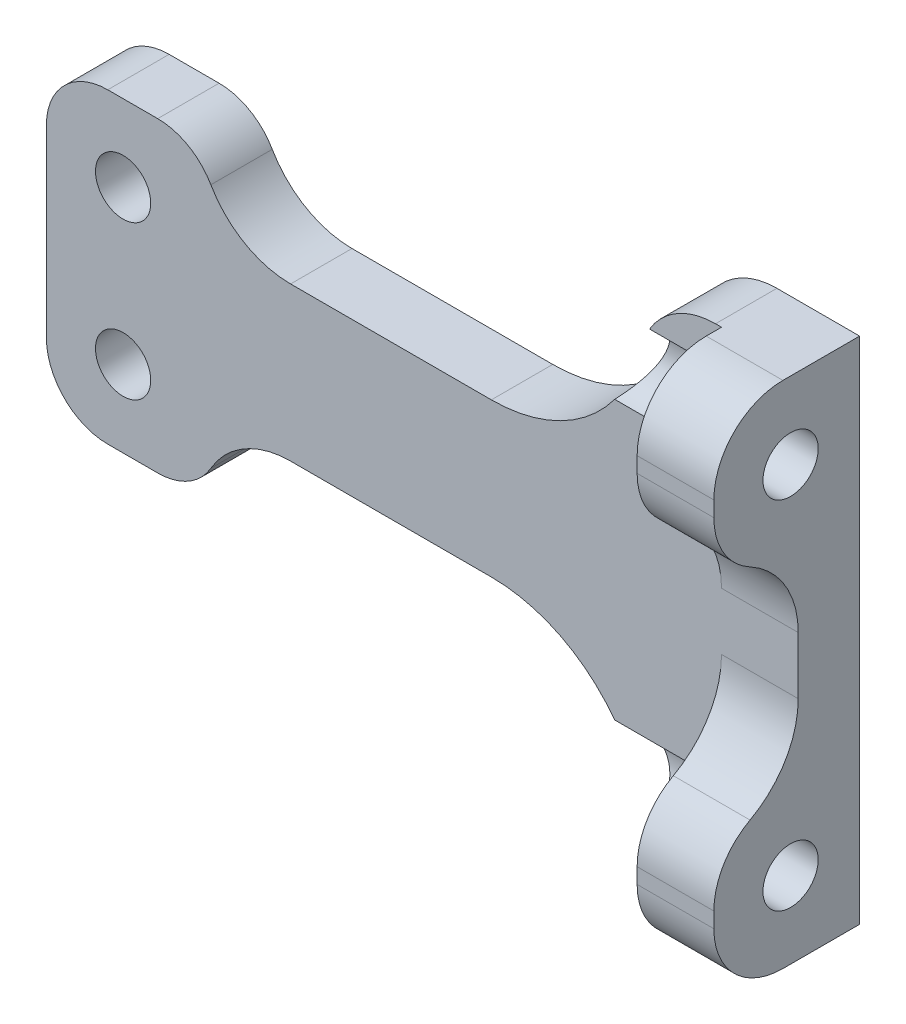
ISO-10303-21;
HEADER;
FILE_DESCRIPTION(('STEP AP214'),'2;1');
FILE_NAME('part.step','',(''),(''),'','','');
FILE_SCHEMA(('AUTOMOTIVE_DESIGN { 1 0 10303 214 1 1 1 1 }'));
ENDSEC;
DATA;
#1=APPLICATION_CONTEXT('core data for automotive mechanical design processes');
#2=APPLICATION_PROTOCOL_DEFINITION('international standard','automotive_design',2000,#1);
#3=PRODUCT_CONTEXT('',#1,'mechanical');
#4=PRODUCT('Part','Part','',(#3));
#5=PRODUCT_RELATED_PRODUCT_CATEGORY('part','',(#4));
#6=PRODUCT_DEFINITION_FORMATION('','',#4);
#7=PRODUCT_DEFINITION_CONTEXT('part definition',#1,'design');
#8=PRODUCT_DEFINITION('design','',#6,#7);
#9=PRODUCT_DEFINITION_SHAPE('','',#8);
#10=(LENGTH_UNIT() NAMED_UNIT(*) SI_UNIT(.MILLI.,.METRE.));
#11=(NAMED_UNIT(*) PLANE_ANGLE_UNIT() SI_UNIT($,.RADIAN.));
#12=(NAMED_UNIT(*) SI_UNIT($,.STERADIAN.) SOLID_ANGLE_UNIT());
#13=UNCERTAINTY_MEASURE_WITH_UNIT(LENGTH_MEASURE(1.E-05),#10,'distance_accuracy_value','');
#14=(GEOMETRIC_REPRESENTATION_CONTEXT(3) GLOBAL_UNCERTAINTY_ASSIGNED_CONTEXT((#13)) GLOBAL_UNIT_ASSIGNED_CONTEXT((#10,
#11,#12)) REPRESENTATION_CONTEXT('',''));
#15=CARTESIAN_POINT('',(0.,0.,0.));
#16=DIRECTION('',(0.,0.,1.));
#17=DIRECTION('',(1.,0.,0.));
#18=AXIS2_PLACEMENT_3D('',#15,#16,#17);
#19=CARTESIAN_POINT('',(3.91666666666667,0.525000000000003,44.2616442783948));
#20=DIRECTION('',(0.,-1.,0.));
#21=DIRECTION('',(1.,0.,0.));
#22=AXIS2_PLACEMENT_3D('',#19,#20,#21);
#23=PLANE('',#22);
#24=DIRECTION('',(-1.,0.,0.));
#25=VECTOR('',#24,1.);
#26=CARTESIAN_POINT('',(3.91666666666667,0.525000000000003,0.));
#27=LINE('',#26,#25);
#28=CARTESIAN_POINT('',(-6.08333333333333,0.525000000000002,0.));
#29=VERTEX_POINT('',#28);
#30=CARTESIAN_POINT('',(-19.1672535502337,0.525,0.));
#31=VERTEX_POINT('',#30);
#32=EDGE_CURVE('E294',#29,#31,#27,.T.);
#33=ORIENTED_EDGE('',*,*,#32,.T.);
#34=DIRECTION('',(0.,0.,1.));
#35=VECTOR('',#34,1.);
#36=CARTESIAN_POINT('',(-19.1672535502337,0.525,44.2616442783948));
#37=LINE('',#36,#35);
#38=CARTESIAN_POINT('',(-19.1672535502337,0.525,4.));
#39=VERTEX_POINT('',#38);
#40=EDGE_CURVE('E417',#31,#39,#37,.T.);
#41=ORIENTED_EDGE('',*,*,#40,.T.);
#42=DIRECTION('',(-1.,0.,0.));
#43=VECTOR('',#42,1.);
#44=CARTESIAN_POINT('',(3.91666666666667,0.525000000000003,4.));
#45=LINE('',#44,#43);
#46=CARTESIAN_POINT('',(-6.08333333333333,0.525000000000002,4.));
#47=VERTEX_POINT('',#46);
#48=EDGE_CURVE('E305',#47,#39,#45,.T.);
#49=ORIENTED_EDGE('',*,*,#48,.F.);
#50=DIRECTION('',(0.,0.,-1.));
#51=VECTOR('',#50,1.);
#52=CARTESIAN_POINT('',(-6.08333333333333,0.525000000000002,0.));
#53=LINE('',#52,#51);
#54=EDGE_CURVE('E329',#47,#29,#53,.T.);
#55=ORIENTED_EDGE('',*,*,#54,.T.);
#56=EDGE_LOOP('',(#33,#41,#49,#55));
#57=FACE_BOUND('',#56,.T.);
#58=ADVANCED_FACE('F35',(#57),#23,.F.);
#59=CARTESIAN_POINT('',(3.91666666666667,-9.475,44.2616442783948));
#60=DIRECTION('',(0.,1.,0.));
#61=DIRECTION('',(-1.,0.,0.));
#62=AXIS2_PLACEMENT_3D('',#59,#60,#61);
#63=PLANE('',#62);
#64=DIRECTION('',(1.,0.,0.));
#65=VECTOR('',#64,1.);
#66=CARTESIAN_POINT('',(3.91666666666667,-9.475,4.));
#67=LINE('',#66,#65);
#68=CARTESIAN_POINT('',(-19.1672535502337,-9.47499999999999,4.));
#69=VERTEX_POINT('',#68);
#70=CARTESIAN_POINT('',(-6.08333333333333,-9.475,4.));
#71=VERTEX_POINT('',#70);
#72=EDGE_CURVE('E297',#69,#71,#67,.T.);
#73=ORIENTED_EDGE('',*,*,#72,.F.);
#74=DIRECTION('',(0.,0.,-1.));
#75=VECTOR('',#74,1.);
#76=CARTESIAN_POINT('',(-19.1672535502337,-9.47499999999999,44.2616442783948));
#77=LINE('',#76,#75);
#78=CARTESIAN_POINT('',(-19.1672535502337,-9.47499999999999,0.));
#79=VERTEX_POINT('',#78);
#80=EDGE_CURVE('E415',#69,#79,#77,.T.);
#81=ORIENTED_EDGE('',*,*,#80,.T.);
#82=DIRECTION('',(1.,0.,0.));
#83=VECTOR('',#82,1.);
#84=CARTESIAN_POINT('',(3.91666666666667,-9.475,0.));
#85=LINE('',#84,#83);
#86=CARTESIAN_POINT('',(-6.08333333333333,-9.475,0.));
#87=VERTEX_POINT('',#86);
#88=EDGE_CURVE('E295',#79,#87,#85,.T.);
#89=ORIENTED_EDGE('',*,*,#88,.T.);
#90=DIRECTION('',(0.,0.,-1.));
#91=VECTOR('',#90,1.);
#92=CARTESIAN_POINT('',(-6.08333333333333,-9.475,4.));
#93=LINE('',#92,#91);
#94=EDGE_CURVE('E332',#87,#71,#93,.F.);
#95=ORIENTED_EDGE('',*,*,#94,.T.);
#96=EDGE_LOOP('',(#73,#81,#89,#95));
#97=FACE_BOUND('',#96,.T.);
#98=ADVANCED_FACE('F564',(#97),#63,.F.);
#99=CARTESIAN_POINT('',(0.916666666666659,7.12499999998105,4.5));
#100=DIRECTION('',(1.,0.,0.));
#101=DIRECTION('',(0.,1.,0.));
#102=AXIS2_PLACEMENT_3D('',#99,#100,#101);
#103=CYLINDRICAL_SURFACE('',#102,1.8);
#104=CARTESIAN_POINT('',(13.9166666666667,7.12499999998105,4.5));
#105=DIRECTION('',(-1.,0.,0.));
#106=DIRECTION('',(0.,-1.,0.));
#107=AXIS2_PLACEMENT_3D('',#104,#105,#106);
#108=CIRCLE('',#107,1.8);
#109=CARTESIAN_POINT('',(13.9166666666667,5.32499999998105,4.5));
#110=VERTEX_POINT('',#109);
#111=EDGE_CURVE('E277',#110,#110,#108,.T.);
#112=ORIENTED_EDGE('',*,*,#111,.F.);
#113=EDGE_LOOP('',(#112));
#114=FACE_BOUND('',#113,.T.);
#115=CARTESIAN_POINT('',(10.1291022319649,7.12499999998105,4.5));
#116=DIRECTION('',(-1.,0.,0.));
#117=DIRECTION('',(0.,0.,1.));
#118=AXIS2_PLACEMENT_3D('',#115,#116,#117);
#119=CIRCLE('',#118,1.8);
#120=CARTESIAN_POINT('',(10.1291022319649,7.12499999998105,6.3));
#121=VERTEX_POINT('',#120);
#122=EDGE_CURVE('E484',#121,#121,#119,.T.);
#123=ORIENTED_EDGE('',*,*,#122,.T.);
#124=EDGE_LOOP('',(#123));
#125=FACE_BOUND('',#124,.T.);
#126=ADVANCED_FACE('F571',(#114,#125),#103,.F.);
#127=CARTESIAN_POINT('',(0.916666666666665,-16.075,4.5));
#128=DIRECTION('',(1.,0.,0.));
#129=DIRECTION('',(0.,1.,0.));
#130=AXIS2_PLACEMENT_3D('',#127,#128,#129);
#131=CYLINDRICAL_SURFACE('',#130,1.8);
#132=CARTESIAN_POINT('',(13.9166666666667,-16.075,4.5));
#133=DIRECTION('',(-1.,0.,0.));
#134=DIRECTION('',(0.,-1.,0.));
#135=AXIS2_PLACEMENT_3D('',#132,#133,#134);
#136=CIRCLE('',#135,1.8);
#137=CARTESIAN_POINT('',(13.9166666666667,-17.875,4.5));
#138=VERTEX_POINT('',#137);
#139=EDGE_CURVE('E594',#138,#138,#136,.T.);
#140=ORIENTED_EDGE('',*,*,#139,.F.);
#141=EDGE_LOOP('',(#140));
#142=FACE_BOUND('',#141,.T.);
#143=CARTESIAN_POINT('',(10.1291022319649,-16.075,4.5));
#144=DIRECTION('',(-1.,0.,0.));
#145=DIRECTION('',(0.,0.,1.));
#146=AXIS2_PLACEMENT_3D('',#143,#144,#145);
#147=CIRCLE('',#146,1.8);
#148=CARTESIAN_POINT('',(10.1291022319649,-16.075,6.3));
#149=VERTEX_POINT('',#148);
#150=EDGE_CURVE('E255',#149,#149,#147,.T.);
#151=ORIENTED_EDGE('',*,*,#150,.T.);
#152=EDGE_LOOP('',(#151));
#153=FACE_BOUND('',#152,.T.);
#154=ADVANCED_FACE('F526',(#142,#153),#131,.F.);
#155=CARTESIAN_POINT('',(0.,0.,4.));
#156=DIRECTION('',(0.,0.,1.));
#157=DIRECTION('',(1.,0.,0.));
#158=AXIS2_PLACEMENT_3D('',#155,#156,#157);
#159=PLANE('',#158);
#160=CARTESIAN_POINT('',(-30.0833333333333,0.52500000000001,4.));
#161=DIRECTION('',(0.,0.,1.));
#162=DIRECTION('',(1.,0.,0.));
#163=AXIS2_PLACEMENT_3D('',#160,#161,#162);
#164=CIRCLE('',#163,1.8);
#165=CARTESIAN_POINT('',(-28.2833333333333,0.52500000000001,4.));
#166=VERTEX_POINT('',#165);
#167=EDGE_CURVE('E665',#166,#166,#164,.T.);
#168=ORIENTED_EDGE('',*,*,#167,.F.);
#169=EDGE_LOOP('',(#168));
#170=FACE_BOUND('',#169,.T.);
#171=CARTESIAN_POINT('',(-30.0833333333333,-9.47499999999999,4.));
#172=DIRECTION('',(0.,0.,1.));
#173=DIRECTION('',(1.,0.,0.));
#174=AXIS2_PLACEMENT_3D('',#171,#172,#173);
#175=CIRCLE('',#174,1.8);
#176=CARTESIAN_POINT('',(-28.2833333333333,-9.47499999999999,4.));
#177=VERTEX_POINT('',#176);
#178=EDGE_CURVE('E658',#177,#177,#175,.T.);
#179=ORIENTED_EDGE('',*,*,#178,.F.);
#180=EDGE_LOOP('',(#179));
#181=FACE_BOUND('',#180,.T.);
#182=DIRECTION('',(1.,0.,0.));
#183=VECTOR('',#182,1.);
#184=CARTESIAN_POINT('',(-35.0833333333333,-14.475,4.));
#185=LINE('',#184,#183);
#186=CARTESIAN_POINT('',(-31.0833333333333,-14.475,4.));
#187=VERTEX_POINT('',#186);
#188=CARTESIAN_POINT('',(-27.8275075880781,-14.475,4.));
#189=VERTEX_POINT('',#188);
#190=EDGE_CURVE('E478',#187,#189,#185,.T.);
#191=ORIENTED_EDGE('',*,*,#190,.T.);
#192=CARTESIAN_POINT('',(-27.8275075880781,-10.475,4.));
#193=DIRECTION('',(0.,0.,1.));
#194=DIRECTION('',(1.,0.,0.));
#195=AXIS2_PLACEMENT_3D('',#192,#193,#194);
#196=CIRCLE('',#195,4.);
#197=CARTESIAN_POINT('',(-24.3634059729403,-12.475,4.));
#198=VERTEX_POINT('',#197);
#199=EDGE_CURVE('E450',#189,#198,#196,.T.);
#200=ORIENTED_EDGE('',*,*,#199,.T.);
#201=CARTESIAN_POINT('',(-19.1672535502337,-15.475,4.));
#202=DIRECTION('',(0.,0.,1.));
#203=DIRECTION('',(1.,0.,0.));
#204=AXIS2_PLACEMENT_3D('',#201,#202,#203);
#205=CIRCLE('',#204,6.);
#206=EDGE_CURVE('E419',#198,#69,#205,.F.);
#207=ORIENTED_EDGE('',*,*,#206,.T.);
#208=ORIENTED_EDGE('',*,*,#72,.T.);
#209=CARTESIAN_POINT('',(-6.08333333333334,-19.475,4.));
#210=DIRECTION('',(0.,0.,1.));
#211=DIRECTION('',(1.,0.,0.));
#212=AXIS2_PLACEMENT_3D('',#209,#210,#211);
#213=CIRCLE('',#212,10.);
#214=CARTESIAN_POINT('',(1.95283508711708,-13.5235298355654,4.));
#215=VERTEX_POINT('',#214);
#216=EDGE_CURVE('E263',#71,#215,#213,.F.);
#217=ORIENTED_EDGE('',*,*,#216,.T.);
#218=DIRECTION('',(1.,0.,0.));
#219=VECTOR('',#218,1.);
#220=CARTESIAN_POINT('',(-0.0833333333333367,-13.5235298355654,4.));
#221=LINE('',#220,#219);
#222=CARTESIAN_POINT('',(8.91666666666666,-13.5235298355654,4.));
#223=VERTEX_POINT('',#222);
#224=EDGE_CURVE('E246',#215,#223,#221,.T.);
#225=ORIENTED_EDGE('',*,*,#224,.T.);
#226=DIRECTION('',(0.,-1.,0.));
#227=VECTOR('',#226,1.);
#228=CARTESIAN_POINT('',(8.91666666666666,-21.075,4.));
#229=LINE('',#228,#227);
#230=CARTESIAN_POINT('',(8.91666666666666,-6.3419073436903,4.));
#231=VERTEX_POINT('',#230);
#232=EDGE_CURVE('E260',#231,#223,#229,.T.);
#233=ORIENTED_EDGE('',*,*,#232,.F.);
#234=DIRECTION('',(-1.,0.,0.));
#235=VECTOR('',#234,1.);
#236=CARTESIAN_POINT('',(13.9166666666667,-6.3419073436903,4.));
#237=LINE('',#236,#235);
#238=CARTESIAN_POINT('',(13.9166666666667,-6.34190734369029,4.));
#239=VERTEX_POINT('',#238);
#240=EDGE_CURVE('E403',#231,#239,#237,.F.);
#241=ORIENTED_EDGE('',*,*,#240,.T.);
#242=DIRECTION('',(0.,1.,0.));
#243=VECTOR('',#242,1.);
#244=CARTESIAN_POINT('',(13.9166666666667,12.125,4.));
#245=LINE('',#244,#243);
#246=CARTESIAN_POINT('',(13.9166666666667,-2.60809265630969,4.));
#247=VERTEX_POINT('',#246);
#248=EDGE_CURVE('E312',#239,#247,#245,.T.);
#249=ORIENTED_EDGE('',*,*,#248,.T.);
#250=DIRECTION('',(-1.,0.,0.));
#251=VECTOR('',#250,1.);
#252=CARTESIAN_POINT('',(8.91666666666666,-2.60809265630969,4.));
#253=LINE('',#252,#251);
#254=CARTESIAN_POINT('',(8.91666666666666,-2.60809265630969,4.));
#255=VERTEX_POINT('',#254);
#256=EDGE_CURVE('E400',#247,#255,#253,.T.);
#257=ORIENTED_EDGE('',*,*,#256,.T.);
#258=DIRECTION('',(0.,-1.,0.));
#259=VECTOR('',#258,1.);
#260=CARTESIAN_POINT('',(8.91666666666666,12.125,4.));
#261=LINE('',#260,#259);
#262=CARTESIAN_POINT('',(8.91666666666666,4.57352983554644,4.));
#263=VERTEX_POINT('',#262);
#264=EDGE_CURVE('E282',#263,#255,#261,.T.);
#265=ORIENTED_EDGE('',*,*,#264,.F.);
#266=DIRECTION('',(1.,0.,0.));
#267=VECTOR('',#266,1.);
#268=CARTESIAN_POINT('',(-0.0833333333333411,4.57352983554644,4.));
#269=LINE('',#268,#267);
#270=CARTESIAN_POINT('',(1.95283508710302,4.57352983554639,4.00000000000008));
#271=VERTEX_POINT('',#270);
#272=EDGE_CURVE('E740',#263,#271,#269,.F.);
#273=ORIENTED_EDGE('',*,*,#272,.T.);
#274=CARTESIAN_POINT('',(-6.08333333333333,10.525,4.));
#275=DIRECTION('',(0.,0.,1.));
#276=DIRECTION('',(1.,0.,0.));
#277=AXIS2_PLACEMENT_3D('',#274,#275,#276);
#278=CIRCLE('',#277,10.);
#279=EDGE_CURVE('E338',#271,#47,#278,.F.);
#280=ORIENTED_EDGE('',*,*,#279,.T.);
#281=ORIENTED_EDGE('',*,*,#48,.T.);
#282=CARTESIAN_POINT('',(-19.1672535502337,6.525,4.));
#283=DIRECTION('',(0.,0.,1.));
#284=DIRECTION('',(1.,0.,0.));
#285=AXIS2_PLACEMENT_3D('',#282,#283,#284);
#286=CIRCLE('',#285,6.);
#287=CARTESIAN_POINT('',(-24.3634059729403,3.525,4.));
#288=VERTEX_POINT('',#287);
#289=EDGE_CURVE('E426',#39,#288,#286,.F.);
#290=ORIENTED_EDGE('',*,*,#289,.T.);
#291=CARTESIAN_POINT('',(-27.8275075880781,1.525,4.));
#292=DIRECTION('',(0.,0.,1.));
#293=DIRECTION('',(1.,0.,0.));
#294=AXIS2_PLACEMENT_3D('',#291,#292,#293);
#295=CIRCLE('',#294,4.);
#296=CARTESIAN_POINT('',(-27.8275075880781,5.525,4.));
#297=VERTEX_POINT('',#296);
#298=EDGE_CURVE('E448',#288,#297,#295,.T.);
#299=ORIENTED_EDGE('',*,*,#298,.T.);
#300=DIRECTION('',(-1.,0.,0.));
#301=VECTOR('',#300,1.);
#302=CARTESIAN_POINT('',(-35.0833333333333,5.525,4.));
#303=LINE('',#302,#301);
#304=CARTESIAN_POINT('',(-31.0833333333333,5.525,4.));
#305=VERTEX_POINT('',#304);
#306=EDGE_CURVE('E481',#297,#305,#303,.T.);
#307=ORIENTED_EDGE('',*,*,#306,.T.);
#308=CARTESIAN_POINT('',(-31.0833333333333,1.525,4.));
#309=DIRECTION('',(0.,0.,1.));
#310=DIRECTION('',(1.,0.,0.));
#311=AXIS2_PLACEMENT_3D('',#308,#309,#310);
#312=CIRCLE('',#311,4.);
#313=CARTESIAN_POINT('',(-35.0833333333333,1.525,4.));
#314=VERTEX_POINT('',#313);
#315=EDGE_CURVE('E55',#305,#314,#312,.T.);
#316=ORIENTED_EDGE('',*,*,#315,.T.);
#317=DIRECTION('',(0.,-1.,0.));
#318=VECTOR('',#317,1.);
#319=CARTESIAN_POINT('',(-35.0833333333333,-9.47499999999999,4.));
#320=LINE('',#319,#318);
#321=CARTESIAN_POINT('',(-35.0833333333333,-10.475,4.));
#322=VERTEX_POINT('',#321);
#323=EDGE_CURVE('E302',#314,#322,#320,.T.);
#324=ORIENTED_EDGE('',*,*,#323,.T.);
#325=CARTESIAN_POINT('',(-31.0833333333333,-10.475,4.));
#326=DIRECTION('',(0.,0.,1.));
#327=DIRECTION('',(1.,0.,0.));
#328=AXIS2_PLACEMENT_3D('',#325,#326,#327);
#329=CIRCLE('',#328,4.);
#330=EDGE_CURVE('E446',#322,#187,#329,.T.);
#331=ORIENTED_EDGE('',*,*,#330,.T.);
#332=EDGE_LOOP('',(#191,#200,#207,#208,#217,#225,#233,#241,#249,#257,#265,#273,#280,#281,#290,
#299,#307,#316,#324,#331));
#333=FACE_BOUND('',#332,.T.);
#334=ADVANCED_FACE('F259',(#170,#181,#333),#159,.T.);
#335=CARTESIAN_POINT('',(8.91666666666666,-18.6264701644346,4.));
#336=VERTEX_POINT('',#335);
#337=CARTESIAN_POINT('',(8.91666666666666,-21.075,4.));
#338=VERTEX_POINT('',#337);
#339=EDGE_CURVE('E272',#336,#338,#229,.T.);
#340=ORIENTED_EDGE('',*,*,#339,.F.);
#341=DIRECTION('',(1.,0.,0.));
#342=VECTOR('',#341,1.);
#343=CARTESIAN_POINT('',(-0.0833333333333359,-18.6264701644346,4.));
#344=LINE('',#343,#342);
#345=CARTESIAN_POINT('',(4.2262525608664,-18.6264701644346,4.));
#346=VERTEX_POINT('',#345);
#347=EDGE_CURVE('E249',#336,#346,#344,.F.);
#348=ORIENTED_EDGE('',*,*,#347,.T.);
#349=CARTESIAN_POINT('',(8.5262525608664,-16.075,4.));
#350=DIRECTION('',(0.,0.,1.));
#351=DIRECTION('',(1.,0.,0.));
#352=AXIS2_PLACEMENT_3D('',#349,#350,#351);
#353=CIRCLE('',#352,5.);
#354=CARTESIAN_POINT('',(8.5262525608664,-21.075,4.));
#355=VERTEX_POINT('',#354);
#356=EDGE_CURVE('E357',#346,#355,#353,.T.);
#357=ORIENTED_EDGE('',*,*,#356,.T.);
#358=DIRECTION('',(1.,0.,0.));
#359=VECTOR('',#358,1.);
#360=CARTESIAN_POINT('',(3.91666666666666,-21.075,4.));
#361=LINE('',#360,#359);
#362=EDGE_CURVE('E309',#355,#338,#361,.T.);
#363=ORIENTED_EDGE('',*,*,#362,.T.);
#364=EDGE_LOOP('',(#340,#348,#357,#363));
#365=FACE_BOUND('',#364,.T.);
#366=ADVANCED_FACE('F554',(#365),#159,.T.);
#367=CARTESIAN_POINT('',(-6.08333333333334,-19.475,4.));
#368=DIRECTION('',(0.,0.,1.));
#369=DIRECTION('',(1.,0.,0.));
#370=AXIS2_PLACEMENT_3D('',#367,#368,#369);
#371=CYLINDRICAL_SURFACE('',#370,10.);
#372=CARTESIAN_POINT('',(1.91666666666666,-13.475,4.5));
#373=CARTESIAN_POINT('',(1.91666195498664,-13.4749955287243,4.37218786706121));
#374=CARTESIAN_POINT('',(1.92380195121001,-13.4844791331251,4.24439967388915));
#375=CARTESIAN_POINT('',(1.9515419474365,-13.5217401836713,3.99302554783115));
#376=CARTESIAN_POINT('',(1.97214766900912,-13.5495254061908,3.86944142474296));
#377=CARTESIAN_POINT('',(2.02460650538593,-13.6215176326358,3.63056263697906));
#378=CARTESIAN_POINT('',(2.05639661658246,-13.6656327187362,3.51522580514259));
#379=CARTESIAN_POINT('',(2.12870122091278,-13.7683003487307,3.29417776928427));
#380=CARTESIAN_POINT('',(2.16921866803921,-13.8268577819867,3.18846984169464));
#381=CARTESIAN_POINT('',(2.26072070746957,-13.9628231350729,2.97820131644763));
#382=CARTESIAN_POINT('',(2.31233954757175,-14.0415090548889,2.87474797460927));
#383=CARTESIAN_POINT('',(2.42018331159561,-14.2118843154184,2.68193141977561));
#384=CARTESIAN_POINT('',(2.47641066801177,-14.3035805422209,2.59257572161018));
#385=CARTESIAN_POINT('',(2.60142204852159,-14.5158890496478,2.41391773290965));
#386=CARTESIAN_POINT('',(2.67063678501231,-14.6387310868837,2.32755240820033));
#387=CARTESIAN_POINT('',(2.80873635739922,-14.8975938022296,2.17703855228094));
#388=CARTESIAN_POINT('',(2.87762096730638,-15.0336224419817,2.11290355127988));
#389=CARTESIAN_POINT('',(3.0169705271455,-15.326204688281,2.00494605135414));
#390=CARTESIAN_POINT('',(3.08720067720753,-15.4835298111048,1.96288817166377));
#391=CARTESIAN_POINT('',(3.22092327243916,-15.8060451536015,1.90879155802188));
#392=CARTESIAN_POINT('',(3.2844183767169,-15.9712322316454,1.89674093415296));
#393=CARTESIAN_POINT('',(3.39894279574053,-16.2947159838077,1.90454334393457));
#394=CARTESIAN_POINT('',(3.4504738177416,-16.4528744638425,1.92263181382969));
#395=CARTESIAN_POINT('',(3.5440714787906,-16.7658118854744,1.98836931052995));
#396=CARTESIAN_POINT('',(3.58614421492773,-16.9205929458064,2.03599921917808));
#397=CARTESIAN_POINT('',(3.65707121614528,-17.206891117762,2.15465883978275));
#398=CARTESIAN_POINT('',(3.68677894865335,-17.339244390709,2.22317055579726));
#399=CARTESIAN_POINT('',(3.73849106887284,-17.5913007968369,2.38267782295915));
#400=CARTESIAN_POINT('',(3.76049738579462,-17.7110070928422,2.47366773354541));
#401=CARTESIAN_POINT('',(3.79693635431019,-17.9284211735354,2.67095482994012));
#402=CARTESIAN_POINT('',(3.81166688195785,-18.0268797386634,2.7763720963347));
#403=CARTESIAN_POINT('',(3.83613306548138,-18.2052326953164,3.00239241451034));
#404=CARTESIAN_POINT('',(3.84586889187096,-18.2851277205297,3.12299494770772));
#405=CARTESIAN_POINT('',(3.86150282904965,-18.4237569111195,3.37569119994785));
#406=CARTESIAN_POINT('',(3.86740890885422,-18.4825349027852,3.5077604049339));
#407=CARTESIAN_POINT('',(3.87641938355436,-18.5774411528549,3.77989175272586));
#408=CARTESIAN_POINT('',(3.87952367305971,-18.6135685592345,3.91995419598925));
#409=CARTESIAN_POINT('',(3.88362034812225,-18.6623208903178,4.20525521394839));
#410=CARTESIAN_POINT('',(3.88459627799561,-18.6747625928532,4.35052535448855));
#411=CARTESIAN_POINT('',(3.88463378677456,-18.6752306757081,4.64110762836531));
#412=CARTESIAN_POINT('',(3.88369531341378,-18.6632563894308,4.7864197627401));
#413=CARTESIAN_POINT('',(3.87966141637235,-18.6151672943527,5.07338875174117));
#414=CARTESIAN_POINT('',(3.87655989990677,-18.5789843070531,5.21503410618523));
#415=CARTESIAN_POINT('',(3.86750325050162,-18.4834675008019,5.49019820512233));
#416=CARTESIAN_POINT('',(3.86154813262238,-18.424133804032,5.62371699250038));
#417=CARTESIAN_POINT('',(3.84576851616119,-18.2842624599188,5.87848676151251));
#418=CARTESIAN_POINT('',(3.83595317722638,-18.2037751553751,5.99976593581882));
#419=CARTESIAN_POINT('',(3.81125595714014,-18.0240334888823,6.22691605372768));
#420=CARTESIAN_POINT('',(3.79637455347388,-17.9247808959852,6.33278844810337));
#421=CARTESIAN_POINT('',(3.76053570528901,-17.7115331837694,6.52539964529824));
#422=CARTESIAN_POINT('',(3.73962574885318,-17.5976570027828,6.61227900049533));
#423=CARTESIAN_POINT('',(3.69084129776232,-17.3583036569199,6.76568682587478));
#424=CARTESIAN_POINT('',(3.66296730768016,-17.2328273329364,6.83221676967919));
#425=CARTESIAN_POINT('',(3.5998706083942,-16.9743516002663,6.94355697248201));
#426=CARTESIAN_POINT('',(3.56464845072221,-16.8413527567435,6.98836886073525));
#427=CARTESIAN_POINT('',(3.48702187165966,-16.5719042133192,7.05585375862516));
#428=CARTESIAN_POINT('',(3.44461638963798,-16.435454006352,7.07852349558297));
#429=CARTESIAN_POINT('',(3.35168244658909,-16.1579773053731,7.10253750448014));
#430=CARTESIAN_POINT('',(3.30091686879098,-16.0169625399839,7.10308627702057));
#431=CARTESIAN_POINT('',(3.19370194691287,-15.7388436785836,7.08195097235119));
#432=CARTESIAN_POINT('',(3.13725095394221,-15.6017407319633,7.06026042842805));
#433=CARTESIAN_POINT('',(3.01560998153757,-15.3236070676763,6.99348556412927));
#434=CARTESIAN_POINT('',(2.95008219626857,-15.1831412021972,6.94666677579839));
#435=CARTESIAN_POINT('',(2.81669425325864,-14.9129546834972,6.83051627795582));
#436=CARTESIAN_POINT('',(2.74883230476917,-14.7832425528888,6.76116692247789));
#437=CARTESIAN_POINT('',(2.60807545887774,-14.5270236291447,6.5949846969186));
#438=CARTESIAN_POINT('',(2.53522247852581,-14.4016450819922,6.49636895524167));
#439=CARTESIAN_POINT('',(2.39436318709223,-14.1696191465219,6.27624954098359));
#440=CARTESIAN_POINT('',(2.32635385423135,-14.0629600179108,6.15476031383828));
#441=CARTESIAN_POINT('',(2.21273977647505,-13.8907655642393,5.91644323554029));
#442=CARTESIAN_POINT('',(2.16535254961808,-13.8212668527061,5.80332975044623));
#443=CARTESIAN_POINT('',(2.08041208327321,-13.6992931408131,5.5648521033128));
#444=CARTESIAN_POINT('',(2.04285022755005,-13.6468032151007,5.43949880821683));
#445=CARTESIAN_POINT('',(1.98145385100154,-13.5621378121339,5.18097672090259));
#446=CARTESIAN_POINT('',(1.9574245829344,-13.5296734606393,5.04795088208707));
#447=CARTESIAN_POINT('',(1.92504077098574,-13.4861168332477,4.77660401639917));
#448=CARTESIAN_POINT('',(1.91667176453,-13.4750048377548,4.63828799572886));
#449=CARTESIAN_POINT('',(1.91666666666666,-13.475,4.5));
#450=B_SPLINE_CURVE_WITH_KNOTS('',3,(#372,#373,#374,#375,#376,#377,#378,#379,#380,#381,#382,
#383,#384,#385,#386,#387,#388,#389,#390,#391,#392,#393,#394,#395,#396,#397,#398,#399,#400,#401,
#402,#403,#404,#405,#406,#407,#408,#409,#410,#411,#412,#413,#414,#415,#416,#417,#418,#419,#420,
#421,#422,#423,#424,#425,#426,#427,#428,#429,#430,#431,#432,#433,#434,#435,#436,#437,#438,#439,
#440,#441,#442,#443,#444,#445,#446,#447,#448,#449),.UNSPECIFIED.,.T.,.F.,(4,2,2,2,2,2,2,2,2,2,2,
2,2,2,2,2,2,2,2,2,2,2,2,2,2,2,2,2,2,2,2,2,2,2,2,2,2,2,4),(0.,0.382871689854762,
0.765906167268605,1.14681661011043,1.52785618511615,1.94588050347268,2.36412690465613,
2.85807483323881,3.35232287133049,3.88164785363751,4.41076306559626,4.90997502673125,
5.40886425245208,5.86244496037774,6.31591196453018,6.74884114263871,7.18175554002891,
7.6137662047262,8.04579311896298,8.48114863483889,8.91651603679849,9.35311474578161,
9.78971115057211,10.2252777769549,10.6608033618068,11.0929878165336,11.5251409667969,
11.9572616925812,12.3894462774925,12.8371594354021,13.2850028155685,13.7687138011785,
14.252804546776,14.7764565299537,15.2997789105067,15.7210080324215,16.1418665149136,
16.5565026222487,16.9707556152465),.UNSPECIFIED.);
#451=CARTESIAN_POINT('',(3.65639059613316,-17.2083333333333,2.16000949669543));
#452=VERTEX_POINT('',#451);
#453=EDGE_CURVE('E504',#215,#452,#450,.T.);
#454=ORIENTED_EDGE('',*,*,#453,.F.);
#455=ORIENTED_EDGE('',*,*,#216,.F.);
#456=ORIENTED_EDGE('',*,*,#94,.F.);
#457=CARTESIAN_POINT('',(-6.08333333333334,-19.475,0.));
#458=DIRECTION('',(0.,0.,1.));
#459=DIRECTION('',(1.,0.,0.));
#460=AXIS2_PLACEMENT_3D('',#457,#458,#459);
#461=CIRCLE('',#460,10.);
#462=CARTESIAN_POINT('',(3.65639059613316,-17.2083333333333,0.));
#463=VERTEX_POINT('',#462);
#464=EDGE_CURVE('E340',#463,#87,#461,.T.);
#465=ORIENTED_EDGE('',*,*,#464,.F.);
#466=DIRECTION('',(0.,0.,1.));
#467=VECTOR('',#466,1.);
#468=CARTESIAN_POINT('',(3.65639059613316,-17.2083333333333,4.));
#469=LINE('',#468,#467);
#470=EDGE_CURVE('E351',#463,#452,#469,.T.);
#471=ORIENTED_EDGE('',*,*,#470,.T.);
#472=EDGE_LOOP('',(#454,#455,#456,#465,#471));
#473=FACE_BOUND('',#472,.T.);
#474=ADVANCED_FACE('F551',(#473),#371,.F.);
#475=CARTESIAN_POINT('',(8.5262525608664,-16.075,4.));
#476=DIRECTION('',(0.,0.,1.));
#477=DIRECTION('',(1.,0.,0.));
#478=AXIS2_PLACEMENT_3D('',#475,#476,#477);
#479=CYLINDRICAL_SURFACE('',#478,5.);
#480=ORIENTED_EDGE('',*,*,#356,.F.);
#481=CARTESIAN_POINT('',(4.25542126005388,-13.475,4.5));
#482=CARTESIAN_POINT('',(4.25540652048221,-13.4750116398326,4.63461463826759));
#483=CARTESIAN_POINT('',(4.24895764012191,-13.4855264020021,4.76938538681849));
#484=CARTESIAN_POINT('',(4.2241197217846,-13.5270210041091,5.03471729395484));
#485=CARTESIAN_POINT('',(4.20570762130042,-13.5580403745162,5.16526980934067));
#486=CARTESIAN_POINT('',(4.15967051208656,-13.6387964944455,5.41782067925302));
#487=CARTESIAN_POINT('',(4.13209777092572,-13.6884272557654,5.5398629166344));
#488=CARTESIAN_POINT('',(4.07092803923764,-13.8046729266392,5.77385359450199));
#489=CARTESIAN_POINT('',(4.03733032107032,-13.8712898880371,5.88580081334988));
#490=CARTESIAN_POINT('',(3.9642250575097,-14.0266093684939,6.10748728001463));
#491=CARTESIAN_POINT('',(3.924457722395,-14.1167562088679,6.21612937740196));
#492=CARTESIAN_POINT('',(3.84558493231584,-14.3135810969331,6.41761654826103));
#493=CARTESIAN_POINT('',(3.80647984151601,-14.4202679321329,6.51045316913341));
#494=CARTESIAN_POINT('',(3.72986312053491,-14.6568289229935,6.68446929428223));
#495=CARTESIAN_POINT('',(3.69268637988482,-14.7878375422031,6.76426805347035));
#496=CARTESIAN_POINT('',(3.62754513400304,-15.0637172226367,6.90018792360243));
#497=CARTESIAN_POINT('',(3.59957435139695,-15.2085787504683,6.95632517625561));
#498=CARTESIAN_POINT('',(3.55787892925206,-15.4964021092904,7.03887846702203));
#499=CARTESIAN_POINT('',(3.54323387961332,-15.6386730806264,7.06722750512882));
#500=CARTESIAN_POINT('',(3.52637855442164,-15.9266443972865,7.09979740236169));
#501=CARTESIAN_POINT('',(3.52416003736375,-16.0723424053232,7.10403425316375));
#502=CARTESIAN_POINT('',(3.53200109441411,-16.3483649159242,7.08893186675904));
#503=CARTESIAN_POINT('',(3.54092761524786,-16.4788486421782,7.07176849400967));
#504=CARTESIAN_POINT('',(3.56830283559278,-16.7347719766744,7.01829154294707));
#505=CARTESIAN_POINT('',(3.58675225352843,-16.8602112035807,6.98197651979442));
#506=CARTESIAN_POINT('',(3.63180015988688,-17.1045551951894,6.89107447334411));
#507=CARTESIAN_POINT('',(3.65850012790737,-17.2233555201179,6.83625907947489));
#508=CARTESIAN_POINT('',(3.71769564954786,-17.450339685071,6.71027394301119));
#509=CARTESIAN_POINT('',(3.75019320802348,-17.5585198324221,6.63909854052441));
#510=CARTESIAN_POINT('',(3.82182539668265,-17.7727519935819,6.47425463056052));
#511=CARTESIAN_POINT('',(3.86129876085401,-17.8775089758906,6.37904842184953));
#512=CARTESIAN_POINT('',(3.94043752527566,-18.0702898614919,6.1729544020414));
#513=CARTESIAN_POINT('',(3.98010306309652,-18.1582990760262,6.06205297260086));
#514=CARTESIAN_POINT('',(4.05833991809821,-18.3214498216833,5.8177685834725));
#515=CARTESIAN_POINT('',(4.09662184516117,-18.3951899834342,5.6833371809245));
#516=CARTESIAN_POINT('',(4.14669925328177,-18.4876213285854,5.472204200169));
#517=CARTESIAN_POINT('',(4.16216967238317,-18.5154054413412,5.40023127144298));
#518=CARTESIAN_POINT('',(4.1900429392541,-18.5645955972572,5.25357941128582));
#519=CARTESIAN_POINT('',(4.20244775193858,-18.5860057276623,5.17890224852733));
#520=CARTESIAN_POINT('',(4.22277846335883,-18.62067909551,5.03352390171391));
#521=CARTESIAN_POINT('',(4.23098386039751,-18.6344581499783,4.96298442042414));
#522=CARTESIAN_POINT('',(4.24398031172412,-18.656144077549,4.82073028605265));
#523=CARTESIAN_POINT('',(4.24877321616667,-18.6640541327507,4.7490162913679));
#524=CARTESIAN_POINT('',(4.2547338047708,-18.6738771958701,4.60505790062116));
#525=CARTESIAN_POINT('',(4.25590325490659,-18.6757931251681,4.532813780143));
#526=CARTESIAN_POINT('',(4.25457659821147,-18.6736111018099,4.388473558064));
#527=CARTESIAN_POINT('',(4.2520807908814,-18.6695136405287,4.31637744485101));
#528=CARTESIAN_POINT('',(4.24028490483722,-18.6500208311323,4.11898460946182));
#529=CARTESIAN_POINT('',(4.22727922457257,-18.6284463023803,3.99445490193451));
#530=CARTESIAN_POINT('',(4.19194614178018,-18.5679861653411,3.75114508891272));
#531=CARTESIAN_POINT('',(4.16961537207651,-18.5290943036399,3.63236707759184));
#532=CARTESIAN_POINT('',(4.11699873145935,-18.4333021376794,3.39764005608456));
#533=CARTESIAN_POINT('',(4.08639757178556,-18.3756640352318,3.2820646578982));
#534=CARTESIAN_POINT('',(4.02091982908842,-18.2446398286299,3.06154994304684));
#535=CARTESIAN_POINT('',(3.98604105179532,-18.1712456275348,2.95661613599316));
#536=CARTESIAN_POINT('',(3.91013972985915,-17.9989371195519,2.7451357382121));
#537=CARTESIAN_POINT('',(3.86893534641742,-17.8978961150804,2.64037879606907));
#538=CARTESIAN_POINT('',(3.78913398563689,-17.679139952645,2.44868476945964));
#539=CARTESIAN_POINT('',(3.75053813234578,-17.5614176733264,2.36175533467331));
#540=CARTESIAN_POINT('',(3.67859143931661,-17.3071595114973,2.20548446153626));
#541=CARTESIAN_POINT('',(3.6454718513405,-17.1701088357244,2.13686627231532));
#542=CARTESIAN_POINT('',(3.59002567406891,-16.8841920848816,2.02436961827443));
#543=CARTESIAN_POINT('',(3.56768887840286,-16.7353373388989,1.98046775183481));
#544=CARTESIAN_POINT('',(3.53807715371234,-16.4454846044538,1.92270707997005));
#545=CARTESIAN_POINT('',(3.52956008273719,-16.3051081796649,1.90636461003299));
#546=CARTESIAN_POINT('',(3.52453792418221,-16.0233720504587,1.89669929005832));
#547=CARTESIAN_POINT('',(3.52802788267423,-15.88201277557,1.90336694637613));
#548=CARTESIAN_POINT('',(3.54591209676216,-15.613509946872,1.93797372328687));
#549=CARTESIAN_POINT('',(3.55947078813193,-15.486094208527,1.96428366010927));
#550=CARTESIAN_POINT('',(3.5952549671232,-15.2377348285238,2.03511273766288));
#551=CARTESIAN_POINT('',(3.61748160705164,-15.1167920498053,2.07963429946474));
#552=CARTESIAN_POINT('',(3.66973698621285,-14.8793271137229,2.18741480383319));
#553=CARTESIAN_POINT('',(3.70004252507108,-14.7631759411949,2.25135270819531));
#554=CARTESIAN_POINT('',(3.7654119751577,-14.5428021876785,2.39531068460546));
#555=CARTESIAN_POINT('',(3.8004780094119,-14.4385849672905,2.47533793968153));
#556=CARTESIAN_POINT('',(3.87636388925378,-14.2333322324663,2.65902740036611));
#557=CARTESIAN_POINT('',(3.91739926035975,-14.1338106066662,2.76429720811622));
#558=CARTESIAN_POINT('',(3.99769907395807,-13.9532105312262,2.99036723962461));
#559=CARTESIAN_POINT('',(4.03696168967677,-13.8721507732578,3.11118301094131));
#560=CARTESIAN_POINT('',(4.11080827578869,-13.7274967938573,3.3720078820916));
#561=CARTESIAN_POINT('',(4.14510589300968,-13.6648415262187,3.51263225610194));
#562=CARTESIAN_POINT('',(4.18741919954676,-13.5899778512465,3.73148273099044));
#563=CARTESIAN_POINT('',(4.19999436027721,-13.5682206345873,3.80568285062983));
#564=CARTESIAN_POINT('',(4.22158177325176,-13.5313274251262,3.95619953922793));
#565=CARTESIAN_POINT('',(4.23059644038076,-13.5161869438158,4.03251463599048));
#566=CARTESIAN_POINT('',(4.24347355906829,-13.4947026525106,4.17394505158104));
#567=CARTESIAN_POINT('',(4.24793757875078,-13.4873250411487,4.2388504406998));
#568=CARTESIAN_POINT('',(4.25391510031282,-13.4774707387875,4.36915823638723));
#569=CARTESIAN_POINT('',(4.25542842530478,-13.4749943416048,4.43456067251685));
#570=CARTESIAN_POINT('',(4.25542126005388,-13.475,4.5));
#571=B_SPLINE_CURVE_WITH_KNOTS('',3,(#481,#482,#483,#484,#485,#486,#487,#488,#489,#490,#491,
#492,#493,#494,#495,#496,#497,#498,#499,#500,#501,#502,#503,#504,#505,#506,#507,#508,#509,#510,
#511,#512,#513,#514,#515,#516,#517,#518,#519,#520,#521,#522,#523,#524,#525,#526,#527,#528,#529,
#530,#531,#532,#533,#534,#535,#536,#537,#538,#539,#540,#541,#542,#543,#544,#545,#546,#547,#548,
#549,#550,#551,#552,#553,#554,#555,#556,#557,#558,#559,#560,#561,#562,#563,#564,#565,#566,#567,
#568,#569,#570),.UNSPECIFIED.,.T.,.F.,(4,2,2,2,2,2,2,2,2,2,2,2,2,2,2,2,2,2,2,2,2,2,2,2,2,2,2,2,
2,2,2,2,2,2,2,2,2,2,2,2,2,2,2,2,4),(0.,0.403577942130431,0.807936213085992,1.21002587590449,
1.61216413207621,2.0503445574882,2.48875858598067,2.95978324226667,3.4304860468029,
3.86545016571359,4.30012577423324,4.69399627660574,5.08789649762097,5.48684860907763,
5.88593894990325,6.32494532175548,6.76433497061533,7.23568082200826,7.47144158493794,
7.70705084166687,7.92375688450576,8.14034534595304,8.35682823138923,8.57329342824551,
8.95255311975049,9.3319498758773,9.7285811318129,10.1254167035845,10.5772162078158,
11.029209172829,11.4970444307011,11.9644359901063,12.3868686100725,12.8091269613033,
13.1997857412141,13.5904964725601,13.9968536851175,14.4033927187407,14.8531155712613,
15.3032917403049,15.7735229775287,16.0082243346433,16.2427662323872,16.438943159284,
16.63513184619),.UNSPECIFIED.);
#572=EDGE_CURVE('E254',#346,#452,#571,.T.);
#573=ORIENTED_EDGE('',*,*,#572,.T.);
#574=ORIENTED_EDGE('',*,*,#470,.F.);
#575=CARTESIAN_POINT('',(8.5262525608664,-16.075,0.));
#576=DIRECTION('',(0.,0.,1.));
#577=DIRECTION('',(1.,0.,0.));
#578=AXIS2_PLACEMENT_3D('',#575,#576,#577);
#579=CIRCLE('',#578,5.);
#580=CARTESIAN_POINT('',(8.5262525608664,-21.075,0.));
#581=VERTEX_POINT('',#580);
#582=EDGE_CURVE('E349',#581,#463,#579,.F.);
#583=ORIENTED_EDGE('',*,*,#582,.F.);
#584=DIRECTION('',(0.,0.,1.));
#585=VECTOR('',#584,1.);
#586=CARTESIAN_POINT('',(8.5262525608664,-21.075,4.));
#587=LINE('',#586,#585);
#588=EDGE_CURVE('E344',#355,#581,#587,.F.);
#589=ORIENTED_EDGE('',*,*,#588,.F.);
#590=EDGE_LOOP('',(#480,#573,#574,#583,#589));
#591=FACE_BOUND('',#590,.T.);
#592=ADVANCED_FACE('F509',(#591),#479,.T.);
#593=CARTESIAN_POINT('',(8.52625256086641,7.125,4.));
#594=DIRECTION('',(0.,0.,1.));
#595=DIRECTION('',(1.,0.,0.));
#596=AXIS2_PLACEMENT_3D('',#593,#594,#595);
#597=CIRCLE('',#596,5.);
#598=CARTESIAN_POINT('',(8.52625256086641,12.125,4.));
#599=VERTEX_POINT('',#598);
#600=CARTESIAN_POINT('',(4.22625256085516,9.67647016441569,4.00000000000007));
#601=VERTEX_POINT('',#600);
#602=EDGE_CURVE('E354',#599,#601,#597,.T.);
#603=ORIENTED_EDGE('',*,*,#602,.T.);
#604=DIRECTION('',(1.,0.,0.));
#605=VECTOR('',#604,1.);
#606=CARTESIAN_POINT('',(-0.0833333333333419,9.67647016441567,4.));
#607=LINE('',#606,#605);
#608=CARTESIAN_POINT('',(8.91666666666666,9.67647016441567,4.));
#609=VERTEX_POINT('',#608);
#610=EDGE_CURVE('E540',#601,#609,#607,.T.);
#611=ORIENTED_EDGE('',*,*,#610,.T.);
#612=CARTESIAN_POINT('',(8.91666666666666,12.125,4.));
#613=VERTEX_POINT('',#612);
#614=EDGE_CURVE('E287',#613,#609,#261,.T.);
#615=ORIENTED_EDGE('',*,*,#614,.F.);
#616=DIRECTION('',(-1.,0.,0.));
#617=VECTOR('',#616,1.);
#618=CARTESIAN_POINT('',(3.91666666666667,12.125,4.));
#619=LINE('',#618,#617);
#620=EDGE_CURVE('E316',#613,#599,#619,.T.);
#621=ORIENTED_EDGE('',*,*,#620,.T.);
#622=EDGE_LOOP('',(#603,#611,#615,#621));
#623=FACE_BOUND('',#622,.T.);
#624=ADVANCED_FACE('F547',(#623),#159,.T.);
#625=CARTESIAN_POINT('',(-6.08333333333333,10.525,44.2616442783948));
#626=DIRECTION('',(0.,0.,1.));
#627=DIRECTION('',(1.,0.,0.));
#628=AXIS2_PLACEMENT_3D('',#625,#626,#627);
#629=CYLINDRICAL_SURFACE('',#628,10.);
#630=CARTESIAN_POINT('',(3.88461530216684,9.72499999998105,4.5));
#631=CARTESIAN_POINT('',(3.88461419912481,9.72500276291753,4.35452217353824));
#632=CARTESIAN_POINT('',(3.88365558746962,9.7127639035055,4.20907037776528));
#633=CARTESIAN_POINT('',(3.879576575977,9.66417524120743,3.92231289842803));
#634=CARTESIAN_POINT('',(3.87645684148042,9.62783285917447,3.78100595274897));
#635=CARTESIAN_POINT('',(3.86736593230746,9.53208507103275,3.50647954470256));
#636=CARTESIAN_POINT('',(3.86139383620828,9.4726722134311,3.37326271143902));
#637=CARTESIAN_POINT('',(3.84556569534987,9.33256014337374,3.11877832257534));
#638=CARTESIAN_POINT('',(3.8357095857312,9.25186057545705,2.99751096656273));
#639=CARTESIAN_POINT('',(3.81096574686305,9.0720654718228,2.77090630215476));
#640=CARTESIAN_POINT('',(3.79609950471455,8.97304929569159,2.665503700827));
#641=CARTESIAN_POINT('',(3.76019179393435,8.75958290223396,2.47298455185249));
#642=CARTESIAN_POINT('',(3.73915105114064,8.64513449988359,2.38586585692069));
#643=CARTESIAN_POINT('',(3.69020935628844,8.40540004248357,2.23269519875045));
#644=CARTESIAN_POINT('',(3.66235683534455,8.28019437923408,2.16650176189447));
#645=CARTESIAN_POINT('',(3.59934064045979,8.02231504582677,2.05571579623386));
#646=CARTESIAN_POINT('',(3.56417679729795,7.88964120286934,2.01112376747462));
#647=CARTESIAN_POINT('',(3.48613552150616,7.61890387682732,1.94347549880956));
#648=CARTESIAN_POINT('',(3.44315221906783,7.48078981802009,1.9207457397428));
#649=CARTESIAN_POINT('',(3.35056160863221,7.20493712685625,1.89754199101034));
#650=CARTESIAN_POINT('',(3.30095258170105,7.06719860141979,1.89707378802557));
#651=CARTESIAN_POINT('',(3.19315428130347,6.78727456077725,1.91798401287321));
#652=CARTESIAN_POINT('',(3.13462880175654,6.64531801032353,1.94067478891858));
#653=CARTESIAN_POINT('',(3.01328730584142,6.36875902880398,2.00833575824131));
#654=CARTESIAN_POINT('',(2.95046978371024,6.23415920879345,2.05331380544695));
#655=CARTESIAN_POINT('',(2.81693688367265,5.96320397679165,2.16894168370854));
#656=CARTESIAN_POINT('',(2.74601868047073,5.82777526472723,2.24153329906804));
#657=CARTESIAN_POINT('',(2.60476640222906,5.57137584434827,2.4095978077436));
#658=CARTESIAN_POINT('',(2.53443300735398,5.45042023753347,2.5050942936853));
#659=CARTESIAN_POINT('',(2.3950132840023,5.22061264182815,2.72249948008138));
#660=CARTESIAN_POINT('',(2.32614203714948,5.11260000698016,2.84544104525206));
#661=CARTESIAN_POINT('',(2.1988409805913,4.91974004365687,3.11295658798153));
#662=CARTESIAN_POINT('',(2.14039093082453,4.83484763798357,3.25748760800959));
#663=CARTESIAN_POINT('',(2.05460159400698,4.71312280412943,3.52143142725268));
#664=CARTESIAN_POINT('',(2.02313903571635,4.66948835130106,3.63638112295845));
#665=CARTESIAN_POINT('',(1.97143146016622,4.59855878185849,3.87360353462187));
#666=CARTESIAN_POINT('',(1.95117439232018,4.57124610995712,3.99586822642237));
#667=CARTESIAN_POINT('',(1.92377425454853,4.53444234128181,4.24514629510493));
#668=CARTESIAN_POINT('',(1.91669420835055,4.52503688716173,4.37217954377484));
#669=CARTESIAN_POINT('',(1.91663929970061,4.5249633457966,4.62626377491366));
#670=CARTESIAN_POINT('',(1.9236643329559,4.53429512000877,4.75331475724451));
#671=CARTESIAN_POINT('',(1.95000767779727,4.56967864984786,4.99401127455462));
#672=CARTESIAN_POINT('',(1.96838407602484,4.59445052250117,5.10795558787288));
#673=CARTESIAN_POINT('',(2.01496569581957,4.65822058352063,5.32964794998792));
#674=CARTESIAN_POINT('',(2.04317367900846,4.69722276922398,5.43739424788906));
#675=CARTESIAN_POINT('',(2.11000573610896,4.79152119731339,5.65318565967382));
#676=CARTESIAN_POINT('',(2.14928342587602,4.84787281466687,5.76056263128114));
#677=CARTESIAN_POINT('',(2.23446267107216,4.97342123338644,5.96460958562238));
#678=CARTESIAN_POINT('',(2.28036768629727,5.04262474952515,6.06127392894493));
#679=CARTESIAN_POINT('',(2.38527013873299,5.20581161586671,6.2595607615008));
#680=CARTESIAN_POINT('',(2.44513208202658,5.3020128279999,6.358902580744));
#681=CARTESIAN_POINT('',(2.56779827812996,5.50779937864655,6.54047018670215));
#682=CARTESIAN_POINT('',(2.63060465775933,5.61739448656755,6.62268336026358));
#683=CARTESIAN_POINT('',(2.76568903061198,5.86480660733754,6.77955237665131));
#684=CARTESIAN_POINT('',(2.83801620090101,6.00441003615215,6.85137060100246));
#685=CARTESIAN_POINT('',(2.97968818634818,6.29559580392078,6.9691607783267));
#686=CARTESIAN_POINT('',(3.04903232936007,6.4471808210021,7.01512693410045));
#687=CARTESIAN_POINT('',(3.18276646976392,6.76085049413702,7.07940989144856));
#688=CARTESIAN_POINT('',(3.24707561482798,6.92305051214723,7.0973394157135));
#689=CARTESIAN_POINT('',(3.36715032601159,7.25104424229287,7.10210656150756));
#690=CARTESIAN_POINT('',(3.4229214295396,7.41683554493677,7.08896442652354));
#691=CARTESIAN_POINT('',(3.51999368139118,7.73197098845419,7.03278747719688));
#692=CARTESIAN_POINT('',(3.56211722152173,7.88152588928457,6.99235912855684));
#693=CARTESIAN_POINT('',(3.63729617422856,8.17298183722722,6.88449968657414));
#694=CARTESIAN_POINT('',(3.67035590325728,8.31488650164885,6.81708148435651));
#695=CARTESIAN_POINT('',(3.72552888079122,8.57498314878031,6.66301138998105));
#696=CARTESIAN_POINT('',(3.74829037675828,8.69416008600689,6.57824720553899));
#697=CARTESIAN_POINT('',(3.78721701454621,8.91718648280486,6.38928971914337));
#698=CARTESIAN_POINT('',(3.80338349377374,9.02103904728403,6.28510036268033));
#699=CARTESIAN_POINT('',(3.82995809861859,9.20767107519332,6.06301521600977));
#700=CARTESIAN_POINT('',(3.84049569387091,9.290898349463,5.94551057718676));
#701=CARTESIAN_POINT('',(3.85757020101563,9.43694741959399,5.69814168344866));
#702=CARTESIAN_POINT('',(3.86410578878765,9.49976245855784,5.56827335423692));
#703=CARTESIAN_POINT('',(3.87475649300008,9.60860010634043,5.28551846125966));
#704=CARTESIAN_POINT('',(3.87854039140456,9.65212732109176,5.13165261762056));
#705=CARTESIAN_POINT('',(3.88347045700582,9.71032638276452,4.81851427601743));
#706=CARTESIAN_POINT('',(3.88461650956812,9.72499697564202,4.65924154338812));
#707=CARTESIAN_POINT('',(3.88461530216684,9.72499999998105,4.5));
#708=B_SPLINE_CURVE_WITH_KNOTS('',3,(#630,#631,#632,#633,#634,#635,#636,#637,#638,#639,#640,
#641,#642,#643,#644,#645,#646,#647,#648,#649,#650,#651,#652,#653,#654,#655,#656,#657,#658,#659,
#660,#661,#662,#663,#664,#665,#666,#667,#668,#669,#670,#671,#672,#673,#674,#675,#676,#677,#678,
#679,#680,#681,#682,#683,#684,#685,#686,#687,#688,#689,#690,#691,#692,#693,#694,#695,#696,#697,
#698,#699,#700,#701,#702,#703,#704,#705,#706,#707),.UNSPECIFIED.,.T.,.F.,(4,2,2,2,2,2,2,2,2,2,2,
2,2,2,2,2,2,2,2,2,2,2,2,2,2,2,2,2,2,2,2,2,2,2,2,2,2,2,4),(0.,0.435874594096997,
0.871615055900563,1.30749637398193,1.74338497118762,2.17742745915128,2.61141894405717,
3.04241018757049,3.47341140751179,3.91075341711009,4.34820910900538,4.81190944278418,
5.2757732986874,5.78127006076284,6.28728975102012,6.81716330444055,7.34599625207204,
7.72520479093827,8.1040047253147,8.48461179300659,8.86521604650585,9.21783427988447,
9.57055164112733,9.95153779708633,10.332723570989,10.7830468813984,11.2337006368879,
11.7498894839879,12.2661940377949,12.7895693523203,13.3126037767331,13.7916585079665,
14.2704847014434,14.7123283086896,15.1540822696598,15.5851825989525,16.0164254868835,
16.4935176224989,16.9706304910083),.UNSPECIFIED.);
#709=CARTESIAN_POINT('',(3.65639059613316,8.25833333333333,2.16000949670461));
#710=VERTEX_POINT('',#709);
#711=EDGE_CURVE('E535',#710,#271,#708,.T.);
#712=ORIENTED_EDGE('',*,*,#711,.F.);
#713=DIRECTION('',(0.,0.,1.));
#714=VECTOR('',#713,1.);
#715=CARTESIAN_POINT('',(3.65639059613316,8.25833333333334,44.2616442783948));
#716=LINE('',#715,#714);
#717=CARTESIAN_POINT('',(3.65639059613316,8.25833333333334,0.));
#718=VERTEX_POINT('',#717);
#719=EDGE_CURVE('E359',#710,#718,#716,.F.);
#720=ORIENTED_EDGE('',*,*,#719,.T.);
#721=CARTESIAN_POINT('',(-6.08333333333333,10.525,0.));
#722=DIRECTION('',(0.,0.,1.));
#723=DIRECTION('',(1.,0.,0.));
#724=AXIS2_PLACEMENT_3D('',#721,#722,#723);
#725=CIRCLE('',#724,10.);
#726=EDGE_CURVE('E335',#29,#718,#725,.T.);
#727=ORIENTED_EDGE('',*,*,#726,.F.);
#728=ORIENTED_EDGE('',*,*,#54,.F.);
#729=ORIENTED_EDGE('',*,*,#279,.F.);
#730=EDGE_LOOP('',(#712,#720,#727,#728,#729));
#731=FACE_BOUND('',#730,.T.);
#732=ADVANCED_FACE('F542',(#731),#629,.F.);
#733=CARTESIAN_POINT('',(8.52625256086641,7.125,44.2616442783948));
#734=DIRECTION('',(0.,0.,1.));
#735=DIRECTION('',(1.,0.,0.));
#736=AXIS2_PLACEMENT_3D('',#733,#734,#735);
#737=CYLINDRICAL_SURFACE('',#736,5.);
#738=ORIENTED_EDGE('',*,*,#719,.F.);
#739=CARTESIAN_POINT('',(4.25542126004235,9.72499999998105,4.5));
#740=CARTESIAN_POINT('',(4.25540652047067,9.72498836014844,4.63461463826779));
#741=CARTESIAN_POINT('',(4.24895764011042,9.71447359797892,4.76938538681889));
#742=CARTESIAN_POINT('',(4.22411972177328,9.67297899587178,5.03471729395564));
#743=CARTESIAN_POINT('',(4.20570762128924,9.6419596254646,5.16526980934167));
#744=CARTESIAN_POINT('',(4.1596705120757,9.561203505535,5.41782067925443));
#745=CARTESIAN_POINT('',(4.13209777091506,9.511572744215,5.53986291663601));
#746=CARTESIAN_POINT('',(4.07092803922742,9.39532707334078,5.77385359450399));
#747=CARTESIAN_POINT('',(4.03733032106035,9.32871011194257,5.88580081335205));
#748=CARTESIAN_POINT('',(3.96422505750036,9.17339063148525,6.107487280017));
#749=CARTESIAN_POINT('',(3.92445772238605,9.08324379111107,6.21612937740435));
#750=CARTESIAN_POINT('',(3.84558493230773,8.88641890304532,6.41761654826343));
#751=CARTESIAN_POINT('',(3.80647984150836,8.77973206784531,6.51045316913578));
#752=CARTESIAN_POINT('',(3.72986312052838,8.54317107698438,6.68446929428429));
#753=CARTESIAN_POINT('',(3.69268637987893,8.41216245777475,6.76426805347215));
#754=CARTESIAN_POINT('',(3.62754513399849,8.13628277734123,6.90018792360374));
#755=CARTESIAN_POINT('',(3.59957435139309,7.99142124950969,6.95632517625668));
#756=CARTESIAN_POINT('',(3.55787892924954,7.70359789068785,7.03887846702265));
#757=CARTESIAN_POINT('',(3.54323387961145,7.56132691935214,7.06722750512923));
#758=CARTESIAN_POINT('',(3.52637855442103,7.27335560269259,7.09979740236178));
#759=CARTESIAN_POINT('',(3.52416003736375,7.12765759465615,7.10403425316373));
#760=CARTESIAN_POINT('',(3.53200109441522,6.85163508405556,7.0889318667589));
#761=CARTESIAN_POINT('',(3.54092761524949,6.72115135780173,7.07176849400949));
#762=CARTESIAN_POINT('',(3.56830283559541,6.46522802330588,7.01829154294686));
#763=CARTESIAN_POINT('',(3.58675225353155,6.33978879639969,6.98197651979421));
#764=CARTESIAN_POINT('',(3.63180015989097,6.09544480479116,6.8910744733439));
#765=CARTESIAN_POINT('',(3.65850012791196,5.97664447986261,6.83625907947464));
#766=CARTESIAN_POINT('',(3.71769564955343,5.74966031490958,6.71027394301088));
#767=CARTESIAN_POINT('',(3.75019320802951,5.64148016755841,6.63909854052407));
#768=CARTESIAN_POINT('',(3.8218253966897,5.42724800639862,6.47425463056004));
#769=CARTESIAN_POINT('',(3.86129876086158,5.32249102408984,6.37904842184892));
#770=CARTESIAN_POINT('',(3.94043752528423,5.12971013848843,6.1729544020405));
#771=CARTESIAN_POINT('',(3.98010306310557,5.04170092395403,6.06205297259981));
#772=CARTESIAN_POINT('',(4.05833991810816,4.87855017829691,5.81776858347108));
#773=CARTESIAN_POINT('',(4.09662184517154,4.80481001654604,5.68333718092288));
#774=CARTESIAN_POINT('',(4.14669925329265,4.71237867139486,5.47220420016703));
#775=CARTESIAN_POINT('',(4.1621696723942,4.68459455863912,5.40023127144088));
#776=CARTESIAN_POINT('',(4.19004293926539,4.63540440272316,5.25357941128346));
#777=CARTESIAN_POINT('',(4.20244775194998,4.61399427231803,5.17890224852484));
#778=CARTESIAN_POINT('',(4.22277846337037,4.57932090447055,5.03352390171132));
#779=CARTESIAN_POINT('',(4.23098386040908,4.56554185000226,4.96298442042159));
#780=CARTESIAN_POINT('',(4.24398031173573,4.54385592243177,4.82073028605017));
#781=CARTESIAN_POINT('',(4.24877321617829,4.53594586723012,4.74901629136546));
#782=CARTESIAN_POINT('',(4.25473380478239,4.52612280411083,4.60505790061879));
#783=CARTESIAN_POINT('',(4.25590325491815,4.52420687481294,4.53281378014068));
#784=CARTESIAN_POINT('',(4.25457659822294,4.52638889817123,4.38847355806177));
#785=CARTESIAN_POINT('',(4.25208079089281,4.53048635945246,4.31637744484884));
#786=CARTESIAN_POINT('',(4.24028490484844,4.54997916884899,4.11898460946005));
#787=CARTESIAN_POINT('',(4.22727922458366,4.57155369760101,3.99445490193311));
#788=CARTESIAN_POINT('',(4.19194614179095,4.63201383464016,3.75114508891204));
#789=CARTESIAN_POINT('',(4.16961537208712,4.6709056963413,3.63236707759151));
#790=CARTESIAN_POINT('',(4.11699873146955,4.76669786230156,3.39764005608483));
#791=CARTESIAN_POINT('',(4.08639757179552,4.82433596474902,3.28206465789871));
#792=CARTESIAN_POINT('',(4.02091982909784,4.95536017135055,3.06154994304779));
#793=CARTESIAN_POINT('',(3.98604105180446,5.02875437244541,2.95661613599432));
#794=CARTESIAN_POINT('',(3.91013972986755,5.20106288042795,2.74513573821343));
#795=CARTESIAN_POINT('',(3.86893534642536,5.30210388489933,2.64037879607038));
#796=CARTESIAN_POINT('',(3.78913398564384,5.52086004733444,2.44868476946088));
#797=CARTESIAN_POINT('',(3.75053813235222,5.63858232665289,2.36175533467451));
#798=CARTESIAN_POINT('',(3.67859143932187,5.89284048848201,2.20548446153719));
#799=CARTESIAN_POINT('',(3.64547185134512,6.02989116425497,2.13686627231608));
#800=CARTESIAN_POINT('',(3.59002567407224,6.31580791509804,2.02436961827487));
#801=CARTESIAN_POINT('',(3.56768887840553,6.46466266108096,1.9804677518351));
#802=CARTESIAN_POINT('',(3.5380771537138,6.75451539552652,1.92270707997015));
#803=CARTESIAN_POINT('',(3.52956008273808,6.89489182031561,1.90636461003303));
#804=CARTESIAN_POINT('',(3.52453792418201,7.17662794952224,1.89669929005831));
#805=CARTESIAN_POINT('',(3.52802788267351,7.31798722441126,1.90336694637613));
#806=CARTESIAN_POINT('',(3.54591209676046,7.58649005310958,1.93797372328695));
#807=CARTESIAN_POINT('',(3.55947078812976,7.7139057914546,1.9642836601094));
#808=CARTESIAN_POINT('',(3.59525496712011,7.96226517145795,2.03511273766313));
#809=CARTESIAN_POINT('',(3.61748160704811,8.08320795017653,2.07963429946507));
#810=CARTESIAN_POINT('',(3.6697369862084,8.32067288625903,2.18741480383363));
#811=CARTESIAN_POINT('',(3.70004252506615,8.43682405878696,2.25135270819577));
#812=CARTESIAN_POINT('',(3.76541197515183,8.65719781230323,2.39531068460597));
#813=CARTESIAN_POINT('',(3.80047800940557,8.76141503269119,2.47533793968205));
#814=CARTESIAN_POINT('',(3.87636388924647,8.96666776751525,2.65902740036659));
#815=CARTESIAN_POINT('',(3.91739926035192,9.0661893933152,2.76429720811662));
#816=CARTESIAN_POINT('',(3.99769907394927,9.24678946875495,2.99036723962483));
#817=CARTESIAN_POINT('',(4.03696168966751,9.32784922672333,3.1111830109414));
#818=CARTESIAN_POINT('',(4.11080827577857,9.47250320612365,3.37200788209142));
#819=CARTESIAN_POINT('',(4.14510589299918,9.53515847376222,3.51263225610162));
#820=CARTESIAN_POINT('',(4.18741919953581,9.61002214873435,3.73148273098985));
#821=CARTESIAN_POINT('',(4.19999436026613,9.63177936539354,3.80568285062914));
#822=CARTESIAN_POINT('',(4.22158177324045,9.66867257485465,3.95619953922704));
#823=CARTESIAN_POINT('',(4.23059644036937,9.68381305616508,4.03251463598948));
#824=CARTESIAN_POINT('',(4.24347355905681,9.70529734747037,4.17394505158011));
#825=CARTESIAN_POINT('',(4.24793757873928,9.71267495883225,4.23885044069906));
#826=CARTESIAN_POINT('',(4.25391510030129,9.72252926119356,4.36915823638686));
#827=CARTESIAN_POINT('',(4.25542842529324,9.72500565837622,4.43456067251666));
#828=CARTESIAN_POINT('',(4.25542126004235,9.72499999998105,4.5));
#829=B_SPLINE_CURVE_WITH_KNOTS('',3,(#739,#740,#741,#742,#743,#744,#745,#746,#747,#748,#749,
#750,#751,#752,#753,#754,#755,#756,#757,#758,#759,#760,#761,#762,#763,#764,#765,#766,#767,#768,
#769,#770,#771,#772,#773,#774,#775,#776,#777,#778,#779,#780,#781,#782,#783,#784,#785,#786,#787,
#788,#789,#790,#791,#792,#793,#794,#795,#796,#797,#798,#799,#800,#801,#802,#803,#804,#805,#806,
#807,#808,#809,#810,#811,#812,#813,#814,#815,#816,#817,#818,#819,#820,#821,#822,#823,#824,#825,
#826,#827,#828),.UNSPECIFIED.,.T.,.F.,(4,2,2,2,2,2,2,2,2,2,2,2,2,2,2,2,2,2,2,2,2,2,2,2,2,2,2,2,
2,2,2,2,2,2,2,2,2,2,2,2,2,2,2,2,4),(0.,0.403577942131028,0.807936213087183,1.2100258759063,
1.61216413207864,2.05034455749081,2.48875858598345,2.95978324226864,3.43048604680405,
3.86545016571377,4.30012577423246,4.69399627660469,5.08789649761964,5.48684860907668,
5.88593894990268,6.32494532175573,6.7643349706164,7.23568082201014,7.47144158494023,
7.70705084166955,7.9237568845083,8.14034534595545,8.35682823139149,8.57329342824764,
8.95255311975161,9.33194987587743,9.7285811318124,10.1254167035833,10.5772162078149,
11.0292091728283,11.4970444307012,11.9644359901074,12.3868686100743,12.8091269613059,
13.1997857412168,13.5904964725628,13.9968536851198,14.4033927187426,14.8531155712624,
15.3032917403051,15.7735229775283,16.0082243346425,16.2427662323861,16.4389431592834,
16.63513184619),.UNSPECIFIED.);
#830=EDGE_CURVE('E530',#710,#601,#829,.T.);
#831=ORIENTED_EDGE('',*,*,#830,.T.);
#832=ORIENTED_EDGE('',*,*,#602,.F.);
#833=DIRECTION('',(0.,0.,1.));
#834=VECTOR('',#833,1.);
#835=CARTESIAN_POINT('',(8.52625256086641,12.125,4.));
#836=LINE('',#835,#834);
#837=CARTESIAN_POINT('',(8.52625256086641,12.125,0.));
#838=VERTEX_POINT('',#837);
#839=EDGE_CURVE('E361',#838,#599,#836,.T.);
#840=ORIENTED_EDGE('',*,*,#839,.F.);
#841=CARTESIAN_POINT('',(8.52625256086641,7.125,0.));
#842=DIRECTION('',(0.,0.,1.));
#843=DIRECTION('',(1.,0.,0.));
#844=AXIS2_PLACEMENT_3D('',#841,#842,#843);
#845=CIRCLE('',#844,5.);
#846=EDGE_CURVE('E347',#718,#838,#845,.F.);
#847=ORIENTED_EDGE('',*,*,#846,.F.);
#848=EDGE_LOOP('',(#738,#831,#832,#840,#847));
#849=FACE_BOUND('',#848,.T.);
#850=ADVANCED_FACE('F546',(#849),#737,.T.);
#851=CARTESIAN_POINT('',(3.91666666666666,-21.075,4.));
#852=DIRECTION('',(0.,1.,0.));
#853=DIRECTION('',(0.,0.,1.));
#854=AXIS2_PLACEMENT_3D('',#851,#852,#853);
#855=PLANE('',#854);
#856=DIRECTION('',(0.,0.,-1.));
#857=VECTOR('',#856,1.);
#858=CARTESIAN_POINT('',(13.9166666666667,-21.075,4.));
#859=LINE('',#858,#857);
#860=CARTESIAN_POINT('',(13.9166666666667,-21.075,5.));
#861=VERTEX_POINT('',#860);
#862=CARTESIAN_POINT('',(13.9166666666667,-21.075,0.));
#863=VERTEX_POINT('',#862);
#864=EDGE_CURVE('E327',#861,#863,#859,.T.);
#865=ORIENTED_EDGE('',*,*,#864,.F.);
#866=DIRECTION('',(1.,0.,0.));
#867=VECTOR('',#866,1.);
#868=CARTESIAN_POINT('',(8.91666666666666,-21.075,5.));
#869=LINE('',#868,#867);
#870=CARTESIAN_POINT('',(8.91666666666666,-21.075,5.));
#871=VERTEX_POINT('',#870);
#872=EDGE_CURVE('E379',#861,#871,#869,.F.);
#873=ORIENTED_EDGE('',*,*,#872,.T.);
#874=DIRECTION('',(0.,0.,-1.));
#875=VECTOR('',#874,1.);
#876=CARTESIAN_POINT('',(8.91666666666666,-21.075,9.5));
#877=LINE('',#876,#875);
#878=EDGE_CURVE('E280',#871,#338,#877,.T.);
#879=ORIENTED_EDGE('',*,*,#878,.T.);
#880=ORIENTED_EDGE('',*,*,#362,.F.);
#881=ORIENTED_EDGE('',*,*,#588,.T.);
#882=DIRECTION('',(1.,0.,0.));
#883=VECTOR('',#882,1.);
#884=CARTESIAN_POINT('',(3.91666666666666,-21.075,0.));
#885=LINE('',#884,#883);
#886=EDGE_CURVE('E304',#581,#863,#885,.T.);
#887=ORIENTED_EDGE('',*,*,#886,.T.);
#888=EDGE_LOOP('',(#865,#873,#879,#880,#881,#887));
#889=FACE_BOUND('',#888,.T.);
#890=ADVANCED_FACE('F549',(#889),#855,.F.);
#891=CARTESIAN_POINT('',(13.9166666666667,12.125,4.));
#892=DIRECTION('',(-1.,0.,0.));
#893=DIRECTION('',(0.,-1.,0.));
#894=AXIS2_PLACEMENT_3D('',#891,#892,#893);
#895=PLANE('',#894);
#896=ORIENTED_EDGE('',*,*,#139,.T.);
#897=EDGE_LOOP('',(#896));
#898=FACE_BOUND('',#897,.T.);
#899=ORIENTED_EDGE('',*,*,#111,.T.);
#900=EDGE_LOOP('',(#899));
#901=FACE_BOUND('',#900,.T.);
#902=DIRECTION('',(0.,1.,0.));
#903=VECTOR('',#902,1.);
#904=CARTESIAN_POINT('',(13.9166666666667,-21.075,9.5));
#905=LINE('',#904,#903);
#906=CARTESIAN_POINT('',(13.9166666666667,-16.575,9.5));
#907=VERTEX_POINT('',#906);
#908=CARTESIAN_POINT('',(13.9166666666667,-15.575,9.5));
#909=VERTEX_POINT('',#908);
#910=EDGE_CURVE('E271',#907,#909,#905,.T.);
#911=ORIENTED_EDGE('',*,*,#910,.F.);
#912=CARTESIAN_POINT('',(13.9166666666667,-16.575,5.));
#913=DIRECTION('',(-1.,0.,0.));
#914=DIRECTION('',(0.,-1.,0.));
#915=AXIS2_PLACEMENT_3D('',#912,#913,#914);
#916=CIRCLE('',#915,4.5);
#917=EDGE_CURVE('E377',#907,#861,#916,.F.);
#918=ORIENTED_EDGE('',*,*,#917,.T.);
#919=ORIENTED_EDGE('',*,*,#864,.T.);
#920=DIRECTION('',(0.,1.,0.));
#921=VECTOR('',#920,1.);
#922=CARTESIAN_POINT('',(13.9166666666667,12.125,0.));
#923=LINE('',#922,#921);
#924=CARTESIAN_POINT('',(13.9166666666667,12.125,0.));
#925=VERTEX_POINT('',#924);
#926=EDGE_CURVE('E321',#863,#925,#923,.T.);
#927=ORIENTED_EDGE('',*,*,#926,.T.);
#928=DIRECTION('',(0.,0.,-1.));
#929=VECTOR('',#928,1.);
#930=CARTESIAN_POINT('',(13.9166666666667,12.125,4.));
#931=LINE('',#930,#929);
#932=CARTESIAN_POINT('',(13.9166666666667,12.125,5.));
#933=VERTEX_POINT('',#932);
#934=EDGE_CURVE('E318',#933,#925,#931,.T.);
#935=ORIENTED_EDGE('',*,*,#934,.F.);
#936=CARTESIAN_POINT('',(13.9166666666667,7.625,5.));
#937=DIRECTION('',(-1.,0.,0.));
#938=DIRECTION('',(0.,-1.,0.));
#939=AXIS2_PLACEMENT_3D('',#936,#937,#938);
#940=CIRCLE('',#939,4.5);
#941=CARTESIAN_POINT('',(13.9166666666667,7.625,9.5));
#942=VERTEX_POINT('',#941);
#943=EDGE_CURVE('E370',#933,#942,#940,.F.);
#944=ORIENTED_EDGE('',*,*,#943,.T.);
#945=DIRECTION('',(0.,1.,0.));
#946=VECTOR('',#945,1.);
#947=CARTESIAN_POINT('',(13.9166666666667,12.125,9.5));
#948=LINE('',#947,#946);
#949=CARTESIAN_POINT('',(13.9166666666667,6.625,9.5));
#950=VERTEX_POINT('',#949);
#951=EDGE_CURVE('E283',#950,#942,#948,.T.);
#952=ORIENTED_EDGE('',*,*,#951,.F.);
#953=CARTESIAN_POINT('',(13.9166666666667,6.625,5.));
#954=DIRECTION('',(-1.,0.,0.));
#955=DIRECTION('',(0.,-1.,0.));
#956=AXIS2_PLACEMENT_3D('',#953,#954,#955);
#957=CIRCLE('',#956,4.5);
#958=CARTESIAN_POINT('',(13.9166666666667,2.66796029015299,7.14285714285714));
#959=VERTEX_POINT('',#958);
#960=EDGE_CURVE('E372',#950,#959,#957,.F.);
#961=ORIENTED_EDGE('',*,*,#960,.T.);
#962=CARTESIAN_POINT('',(13.9166666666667,-2.60809265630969,10.));
#963=DIRECTION('',(-1.,0.,0.));
#964=DIRECTION('',(0.,-1.,0.));
#965=AXIS2_PLACEMENT_3D('',#962,#963,#964);
#966=CIRCLE('',#965,6.);
#967=EDGE_CURVE('E411',#959,#247,#966,.T.);
#968=ORIENTED_EDGE('',*,*,#967,.T.);
#969=ORIENTED_EDGE('',*,*,#248,.F.);
#970=CARTESIAN_POINT('',(13.9166666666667,-6.3419073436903,10.));
#971=DIRECTION('',(-1.,0.,0.));
#972=DIRECTION('',(0.,-1.,0.));
#973=AXIS2_PLACEMENT_3D('',#970,#971,#972);
#974=CIRCLE('',#973,6.);
#975=CARTESIAN_POINT('',(13.9166666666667,-11.617960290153,7.14285714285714));
#976=VERTEX_POINT('',#975);
#977=EDGE_CURVE('E409',#239,#976,#974,.T.);
#978=ORIENTED_EDGE('',*,*,#977,.T.);
#979=CARTESIAN_POINT('',(13.9166666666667,-15.575,5.));
#980=DIRECTION('',(-1.,0.,0.));
#981=DIRECTION('',(0.,-1.,0.));
#982=AXIS2_PLACEMENT_3D('',#979,#980,#981);
#983=CIRCLE('',#982,4.5);
#984=EDGE_CURVE('E375',#976,#909,#983,.F.);
#985=ORIENTED_EDGE('',*,*,#984,.T.);
#986=EDGE_LOOP('',(#911,#918,#919,#927,#935,#944,#952,#961,#968,#969,#978,#985));
#987=FACE_BOUND('',#986,.T.);
#988=ADVANCED_FACE('F583',(#898,#901,#987),#895,.F.);
#989=CARTESIAN_POINT('',(3.91666666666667,12.125,4.));
#990=DIRECTION('',(0.,-1.,0.));
#991=DIRECTION('',(0.,0.,-1.));
#992=AXIS2_PLACEMENT_3D('',#989,#990,#991);
#993=PLANE('',#992);
#994=DIRECTION('',(0.,0.,-1.));
#995=VECTOR('',#994,1.);
#996=CARTESIAN_POINT('',(8.91666666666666,12.125,9.5));
#997=LINE('',#996,#995);
#998=CARTESIAN_POINT('',(8.91666666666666,12.125,5.));
#999=VERTEX_POINT('',#998);
#1000=EDGE_CURVE('E290',#999,#613,#997,.T.);
#1001=ORIENTED_EDGE('',*,*,#1000,.F.);
#1002=DIRECTION('',(-1.,0.,0.));
#1003=VECTOR('',#1002,1.);
#1004=CARTESIAN_POINT('',(3.91666666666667,12.125,5.));
#1005=LINE('',#1004,#1003);
#1006=EDGE_CURVE('E395',#999,#933,#1005,.F.);
#1007=ORIENTED_EDGE('',*,*,#1006,.T.);
#1008=ORIENTED_EDGE('',*,*,#934,.T.);
#1009=DIRECTION('',(-1.,0.,0.));
#1010=VECTOR('',#1009,1.);
#1011=CARTESIAN_POINT('',(3.91666666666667,12.125,0.));
#1012=LINE('',#1011,#1010);
#1013=EDGE_CURVE('E313',#925,#838,#1012,.T.);
#1014=ORIENTED_EDGE('',*,*,#1013,.T.);
#1015=ORIENTED_EDGE('',*,*,#839,.T.);
#1016=ORIENTED_EDGE('',*,*,#620,.F.);
#1017=EDGE_LOOP('',(#1001,#1007,#1008,#1014,#1015,#1016));
#1018=FACE_BOUND('',#1017,.T.);
#1019=ADVANCED_FACE('F580',(#1018),#993,.F.);
#1020=CARTESIAN_POINT('',(0.,0.,0.));
#1021=DIRECTION('',(0.,0.,1.));
#1022=DIRECTION('',(1.,0.,0.));
#1023=AXIS2_PLACEMENT_3D('',#1020,#1021,#1022);
#1024=PLANE('',#1023);
#1025=CARTESIAN_POINT('',(-30.0833333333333,0.52500000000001,0.));
#1026=DIRECTION('',(0.,0.,1.));
#1027=DIRECTION('',(1.,0.,0.));
#1028=AXIS2_PLACEMENT_3D('',#1025,#1026,#1027);
#1029=CIRCLE('',#1028,1.8);
#1030=CARTESIAN_POINT('',(-28.2833333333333,0.52500000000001,0.));
#1031=VERTEX_POINT('',#1030);
#1032=EDGE_CURVE('E668',#1031,#1031,#1029,.T.);
#1033=ORIENTED_EDGE('',*,*,#1032,.T.);
#1034=EDGE_LOOP('',(#1033));
#1035=FACE_BOUND('',#1034,.T.);
#1036=CARTESIAN_POINT('',(-30.0833333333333,-9.47499999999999,0.));
#1037=DIRECTION('',(0.,0.,1.));
#1038=DIRECTION('',(1.,0.,0.));
#1039=AXIS2_PLACEMENT_3D('',#1036,#1037,#1038);
#1040=CIRCLE('',#1039,1.8);
#1041=CARTESIAN_POINT('',(-28.2833333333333,-9.47499999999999,0.));
#1042=VERTEX_POINT('',#1041);
#1043=EDGE_CURVE('E662',#1042,#1042,#1040,.T.);
#1044=ORIENTED_EDGE('',*,*,#1043,.T.);
#1045=EDGE_LOOP('',(#1044));
#1046=FACE_BOUND('',#1045,.T.);
#1047=CARTESIAN_POINT('',(-19.1672535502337,-15.475,0.));
#1048=DIRECTION('',(0.,0.,1.));
#1049=DIRECTION('',(1.,0.,0.));
#1050=AXIS2_PLACEMENT_3D('',#1047,#1048,#1049);
#1051=CIRCLE('',#1050,6.);
#1052=CARTESIAN_POINT('',(-24.3634059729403,-12.475,0.));
#1053=VERTEX_POINT('',#1052);
#1054=EDGE_CURVE('E421',#79,#1053,#1051,.T.);
#1055=ORIENTED_EDGE('',*,*,#1054,.T.);
#1056=CARTESIAN_POINT('',(-27.8275075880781,-10.475,0.));
#1057=DIRECTION('',(0.,0.,1.));
#1058=DIRECTION('',(1.,0.,0.));
#1059=AXIS2_PLACEMENT_3D('',#1056,#1057,#1058);
#1060=CIRCLE('',#1059,4.);
#1061=CARTESIAN_POINT('',(-27.8275075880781,-14.475,0.));
#1062=VERTEX_POINT('',#1061);
#1063=EDGE_CURVE('E438',#1053,#1062,#1060,.F.);
#1064=ORIENTED_EDGE('',*,*,#1063,.T.);
#1065=DIRECTION('',(1.,0.,0.));
#1066=VECTOR('',#1065,1.);
#1067=CARTESIAN_POINT('',(-35.0833333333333,-14.475,0.));
#1068=LINE('',#1067,#1066);
#1069=CARTESIAN_POINT('',(-31.0833333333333,-14.475,0.));
#1070=VERTEX_POINT('',#1069);
#1071=EDGE_CURVE('E469',#1070,#1062,#1068,.T.);
#1072=ORIENTED_EDGE('',*,*,#1071,.F.);
#1073=CARTESIAN_POINT('',(-31.0833333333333,-10.475,0.));
#1074=DIRECTION('',(0.,0.,1.));
#1075=DIRECTION('',(1.,0.,0.));
#1076=AXIS2_PLACEMENT_3D('',#1073,#1074,#1075);
#1077=CIRCLE('',#1076,4.);
#1078=CARTESIAN_POINT('',(-35.0833333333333,-10.475,0.));
#1079=VERTEX_POINT('',#1078);
#1080=EDGE_CURVE('E434',#1070,#1079,#1077,.F.);
#1081=ORIENTED_EDGE('',*,*,#1080,.T.);
#1082=DIRECTION('',(0.,-1.,0.));
#1083=VECTOR('',#1082,1.);
#1084=CARTESIAN_POINT('',(-35.0833333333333,-9.47499999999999,0.));
#1085=LINE('',#1084,#1083);
#1086=CARTESIAN_POINT('',(-35.0833333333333,1.525,0.));
#1087=VERTEX_POINT('',#1086);
#1088=EDGE_CURVE('E298',#1087,#1079,#1085,.T.);
#1089=ORIENTED_EDGE('',*,*,#1088,.F.);
#1090=CARTESIAN_POINT('',(-31.0833333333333,1.525,0.));
#1091=DIRECTION('',(0.,0.,1.));
#1092=DIRECTION('',(1.,0.,0.));
#1093=AXIS2_PLACEMENT_3D('',#1090,#1091,#1092);
#1094=CIRCLE('',#1093,4.);
#1095=CARTESIAN_POINT('',(-31.0833333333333,5.525,0.));
#1096=VERTEX_POINT('',#1095);
#1097=EDGE_CURVE('E432',#1087,#1096,#1094,.F.);
#1098=ORIENTED_EDGE('',*,*,#1097,.T.);
#1099=DIRECTION('',(-1.,0.,0.));
#1100=VECTOR('',#1099,1.);
#1101=CARTESIAN_POINT('',(-35.0833333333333,5.525,0.));
#1102=LINE('',#1101,#1100);
#1103=CARTESIAN_POINT('',(-27.8275075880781,5.525,0.));
#1104=VERTEX_POINT('',#1103);
#1105=EDGE_CURVE('E486',#1104,#1096,#1102,.T.);
#1106=ORIENTED_EDGE('',*,*,#1105,.F.);
#1107=CARTESIAN_POINT('',(-27.8275075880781,1.525,0.));
#1108=DIRECTION('',(0.,0.,1.));
#1109=DIRECTION('',(1.,0.,0.));
#1110=AXIS2_PLACEMENT_3D('',#1107,#1108,#1109);
#1111=CIRCLE('',#1110,4.);
#1112=CARTESIAN_POINT('',(-24.3634059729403,3.525,0.));
#1113=VERTEX_POINT('',#1112);
#1114=EDGE_CURVE('E436',#1104,#1113,#1111,.F.);
#1115=ORIENTED_EDGE('',*,*,#1114,.T.);
#1116=CARTESIAN_POINT('',(-19.1672535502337,6.525,0.));
#1117=DIRECTION('',(0.,0.,1.));
#1118=DIRECTION('',(1.,0.,0.));
#1119=AXIS2_PLACEMENT_3D('',#1116,#1117,#1118);
#1120=CIRCLE('',#1119,6.);
#1121=EDGE_CURVE('E424',#1113,#31,#1120,.T.);
#1122=ORIENTED_EDGE('',*,*,#1121,.T.);
#1123=ORIENTED_EDGE('',*,*,#32,.F.);
#1124=ORIENTED_EDGE('',*,*,#726,.T.);
#1125=ORIENTED_EDGE('',*,*,#846,.T.);
#1126=ORIENTED_EDGE('',*,*,#1013,.F.);
#1127=ORIENTED_EDGE('',*,*,#926,.F.);
#1128=ORIENTED_EDGE('',*,*,#886,.F.);
#1129=ORIENTED_EDGE('',*,*,#582,.T.);
#1130=ORIENTED_EDGE('',*,*,#464,.T.);
#1131=ORIENTED_EDGE('',*,*,#88,.F.);
#1132=EDGE_LOOP('',(#1055,#1064,#1072,#1081,#1089,#1098,#1106,#1115,#1122,#1123,#1124,#1125,
#1126,#1127,#1128,#1129,#1130,#1131));
#1133=FACE_BOUND('',#1132,.T.);
#1134=ADVANCED_FACE('F464',(#1035,#1046,#1133),#1024,.F.);
#1135=CARTESIAN_POINT('',(-35.0833333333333,-9.47499999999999,44.2616442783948));
#1136=DIRECTION('',(1.,0.,0.));
#1137=DIRECTION('',(0.,0.,-1.));
#1138=AXIS2_PLACEMENT_3D('',#1135,#1136,#1137);
#1139=PLANE('',#1138);
#1140=ORIENTED_EDGE('',*,*,#1088,.T.);
#1141=DIRECTION('',(0.,0.,-1.));
#1142=VECTOR('',#1141,1.);
#1143=CARTESIAN_POINT('',(-35.0833333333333,-10.475,44.2616442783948));
#1144=LINE('',#1143,#1142);
#1145=EDGE_CURVE('E11',#1079,#322,#1144,.F.);
#1146=ORIENTED_EDGE('',*,*,#1145,.T.);
#1147=ORIENTED_EDGE('',*,*,#323,.F.);
#1148=DIRECTION('',(0.,0.,-1.));
#1149=VECTOR('',#1148,1.);
#1150=CARTESIAN_POINT('',(-35.0833333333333,1.525,44.2616442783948));
#1151=LINE('',#1150,#1149);
#1152=EDGE_CURVE('E43',#314,#1087,#1151,.T.);
#1153=ORIENTED_EDGE('',*,*,#1152,.T.);
#1154=EDGE_LOOP('',(#1140,#1146,#1147,#1153));
#1155=FACE_BOUND('',#1154,.T.);
#1156=ADVANCED_FACE('F461',(#1155),#1139,.F.);
#1157=CARTESIAN_POINT('',(8.91666666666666,12.125,9.5));
#1158=DIRECTION('',(1.,0.,0.));
#1159=DIRECTION('',(0.,1.,0.));
#1160=AXIS2_PLACEMENT_3D('',#1157,#1158,#1159);
#1161=PLANE('',#1160);
#1162=CARTESIAN_POINT('',(8.91666666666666,7.12499999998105,4.5));
#1163=DIRECTION('',(-1.,0.,0.));
#1164=DIRECTION('',(0.,0.,1.));
#1165=AXIS2_PLACEMENT_3D('',#1162,#1163,#1164);
#1166=CIRCLE('',#1165,2.5);
#1167=CARTESIAN_POINT('',(8.91666666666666,7.12499999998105,7.));
#1168=VERTEX_POINT('',#1167);
#1169=EDGE_CURVE('E480',#1168,#1168,#1166,.T.);
#1170=ORIENTED_EDGE('',*,*,#1169,.F.);
#1171=EDGE_LOOP('',(#1170));
#1172=FACE_BOUND('',#1171,.T.);
#1173=ORIENTED_EDGE('',*,*,#264,.T.);
#1174=CARTESIAN_POINT('',(8.91666666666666,-2.60809265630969,10.));
#1175=DIRECTION('',(1.,0.,0.));
#1176=DIRECTION('',(0.,1.,0.));
#1177=AXIS2_PLACEMENT_3D('',#1174,#1175,#1176);
#1178=CIRCLE('',#1177,6.);
#1179=CARTESIAN_POINT('',(8.91666666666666,2.66796029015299,7.14285714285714));
#1180=VERTEX_POINT('',#1179);
#1181=EDGE_CURVE('E413',#255,#1180,#1178,.T.);
#1182=ORIENTED_EDGE('',*,*,#1181,.T.);
#1183=CARTESIAN_POINT('',(8.91666666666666,6.625,5.));
#1184=DIRECTION('',(1.,0.,0.));
#1185=DIRECTION('',(0.,1.,0.));
#1186=AXIS2_PLACEMENT_3D('',#1183,#1184,#1185);
#1187=CIRCLE('',#1186,4.5);
#1188=CARTESIAN_POINT('',(8.91666666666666,6.625,9.5));
#1189=VERTEX_POINT('',#1188);
#1190=EDGE_CURVE('E393',#1180,#1189,#1187,.F.);
#1191=ORIENTED_EDGE('',*,*,#1190,.T.);
#1192=DIRECTION('',(0.,-1.,0.));
#1193=VECTOR('',#1192,1.);
#1194=CARTESIAN_POINT('',(8.91666666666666,12.125,9.5));
#1195=LINE('',#1194,#1193);
#1196=CARTESIAN_POINT('',(8.91666666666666,7.625,9.5));
#1197=VERTEX_POINT('',#1196);
#1198=EDGE_CURVE('E286',#1197,#1189,#1195,.T.);
#1199=ORIENTED_EDGE('',*,*,#1198,.F.);
#1200=CARTESIAN_POINT('',(8.91666666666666,7.625,5.));
#1201=DIRECTION('',(1.,0.,0.));
#1202=DIRECTION('',(0.,1.,0.));
#1203=AXIS2_PLACEMENT_3D('',#1200,#1201,#1202);
#1204=CIRCLE('',#1203,4.5);
#1205=EDGE_CURVE('E391',#1197,#999,#1204,.F.);
#1206=ORIENTED_EDGE('',*,*,#1205,.T.);
#1207=ORIENTED_EDGE('',*,*,#1000,.T.);
#1208=ORIENTED_EDGE('',*,*,#614,.T.);
#1209=CARTESIAN_POINT('',(8.91666666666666,7.12499999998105,4.5));
#1210=DIRECTION('',(-1.,0.,0.));
#1211=DIRECTION('',(0.,-1.,0.));
#1212=AXIS2_PLACEMENT_3D('',#1209,#1210,#1211);
#1213=CIRCLE('',#1212,2.6);
#1214=EDGE_CURVE('E264',#609,#263,#1213,.T.);
#1215=ORIENTED_EDGE('',*,*,#1214,.T.);
#1216=EDGE_LOOP('',(#1173,#1182,#1191,#1199,#1206,#1207,#1208,#1215));
#1217=FACE_BOUND('',#1216,.T.);
#1218=ADVANCED_FACE('F706',(#1172,#1217),#1161,.F.);
#1219=CARTESIAN_POINT('',(0.,0.,9.5));
#1220=DIRECTION('',(0.,0.,-1.));
#1221=DIRECTION('',(-1.,0.,0.));
#1222=AXIS2_PLACEMENT_3D('',#1219,#1220,#1221);
#1223=PLANE('',#1222);
#1224=ORIENTED_EDGE('',*,*,#1198,.T.);
#1225=DIRECTION('',(1.,0.,0.));
#1226=VECTOR('',#1225,1.);
#1227=CARTESIAN_POINT('',(0.,6.625,9.5));
#1228=LINE('',#1227,#1226);
#1229=EDGE_CURVE('E388',#1189,#950,#1228,.T.);
#1230=ORIENTED_EDGE('',*,*,#1229,.T.);
#1231=ORIENTED_EDGE('',*,*,#951,.T.);
#1232=DIRECTION('',(-1.,0.,0.));
#1233=VECTOR('',#1232,1.);
#1234=CARTESIAN_POINT('',(0.,7.625,9.5));
#1235=LINE('',#1234,#1233);
#1236=EDGE_CURVE('E385',#942,#1197,#1235,.T.);
#1237=ORIENTED_EDGE('',*,*,#1236,.T.);
#1238=EDGE_LOOP('',(#1224,#1230,#1231,#1237));
#1239=FACE_BOUND('',#1238,.T.);
#1240=ADVANCED_FACE('F709',(#1239),#1223,.F.);
#1241=CARTESIAN_POINT('',(8.91666666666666,-21.075,9.5));
#1242=DIRECTION('',(1.,0.,0.));
#1243=DIRECTION('',(0.,0.,-1.));
#1244=AXIS2_PLACEMENT_3D('',#1241,#1242,#1243);
#1245=PLANE('',#1244);
#1246=CARTESIAN_POINT('',(8.91666666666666,-16.075,4.5));
#1247=DIRECTION('',(-1.,0.,0.));
#1248=DIRECTION('',(0.,0.,1.));
#1249=AXIS2_PLACEMENT_3D('',#1246,#1247,#1248);
#1250=CIRCLE('',#1249,2.5);
#1251=CARTESIAN_POINT('',(8.91666666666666,-16.075,7.));
#1252=VERTEX_POINT('',#1251);
#1253=EDGE_CURVE('E493',#1252,#1252,#1250,.T.);
#1254=ORIENTED_EDGE('',*,*,#1253,.F.);
#1255=EDGE_LOOP('',(#1254));
#1256=FACE_BOUND('',#1255,.T.);
#1257=ORIENTED_EDGE('',*,*,#878,.F.);
#1258=CARTESIAN_POINT('',(8.91666666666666,-16.575,5.));
#1259=DIRECTION('',(1.,0.,0.));
#1260=DIRECTION('',(0.,0.,-1.));
#1261=AXIS2_PLACEMENT_3D('',#1258,#1259,#1260);
#1262=CIRCLE('',#1261,4.5);
#1263=CARTESIAN_POINT('',(8.91666666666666,-16.575,9.5));
#1264=VERTEX_POINT('',#1263);
#1265=EDGE_CURVE('E383',#871,#1264,#1262,.F.);
#1266=ORIENTED_EDGE('',*,*,#1265,.T.);
#1267=DIRECTION('',(0.,-1.,0.));
#1268=VECTOR('',#1267,1.);
#1269=CARTESIAN_POINT('',(8.91666666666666,-21.075,9.5));
#1270=LINE('',#1269,#1268);
#1271=CARTESIAN_POINT('',(8.91666666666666,-15.575,9.5));
#1272=VERTEX_POINT('',#1271);
#1273=EDGE_CURVE('E275',#1272,#1264,#1270,.T.);
#1274=ORIENTED_EDGE('',*,*,#1273,.F.);
#1275=CARTESIAN_POINT('',(8.91666666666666,-15.575,5.));
#1276=DIRECTION('',(1.,0.,0.));
#1277=DIRECTION('',(0.,0.,-1.));
#1278=AXIS2_PLACEMENT_3D('',#1275,#1276,#1277);
#1279=CIRCLE('',#1278,4.5);
#1280=CARTESIAN_POINT('',(8.91666666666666,-11.617960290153,7.14285714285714));
#1281=VERTEX_POINT('',#1280);
#1282=EDGE_CURVE('E381',#1272,#1281,#1279,.F.);
#1283=ORIENTED_EDGE('',*,*,#1282,.T.);
#1284=CARTESIAN_POINT('',(8.91666666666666,-6.3419073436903,10.));
#1285=DIRECTION('',(1.,0.,0.));
#1286=DIRECTION('',(0.,0.,-1.));
#1287=AXIS2_PLACEMENT_3D('',#1284,#1285,#1286);
#1288=CIRCLE('',#1287,6.);
#1289=EDGE_CURVE('E269',#1281,#231,#1288,.T.);
#1290=ORIENTED_EDGE('',*,*,#1289,.T.);
#1291=ORIENTED_EDGE('',*,*,#232,.T.);
#1292=CARTESIAN_POINT('',(8.91666666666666,-16.075,4.5));
#1293=DIRECTION('',(-1.,0.,0.));
#1294=DIRECTION('',(0.,-1.,0.));
#1295=AXIS2_PLACEMENT_3D('',#1292,#1293,#1294);
#1296=CIRCLE('',#1295,2.6);
#1297=EDGE_CURVE('E243',#223,#336,#1296,.T.);
#1298=ORIENTED_EDGE('',*,*,#1297,.T.);
#1299=ORIENTED_EDGE('',*,*,#339,.T.);
#1300=EDGE_LOOP('',(#1257,#1266,#1274,#1283,#1290,#1291,#1298,#1299));
#1301=FACE_BOUND('',#1300,.T.);
#1302=ADVANCED_FACE('F267',(#1256,#1301),#1245,.F.);
#1303=CARTESIAN_POINT('',(0.,0.,9.5));
#1304=DIRECTION('',(0.,0.,1.));
#1305=DIRECTION('',(1.,0.,0.));
#1306=AXIS2_PLACEMENT_3D('',#1303,#1304,#1305);
#1307=PLANE('',#1306);
#1308=ORIENTED_EDGE('',*,*,#1273,.T.);
#1309=DIRECTION('',(1.,0.,0.));
#1310=VECTOR('',#1309,1.);
#1311=CARTESIAN_POINT('',(13.9166666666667,-16.575,9.5));
#1312=LINE('',#1311,#1310);
#1313=EDGE_CURVE('E367',#1264,#907,#1312,.T.);
#1314=ORIENTED_EDGE('',*,*,#1313,.T.);
#1315=ORIENTED_EDGE('',*,*,#910,.T.);
#1316=DIRECTION('',(-1.,0.,0.));
#1317=VECTOR('',#1316,1.);
#1318=CARTESIAN_POINT('',(8.91666666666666,-15.575,9.5));
#1319=LINE('',#1318,#1317);
#1320=EDGE_CURVE('E364',#909,#1272,#1319,.T.);
#1321=ORIENTED_EDGE('',*,*,#1320,.T.);
#1322=EDGE_LOOP('',(#1308,#1314,#1315,#1321));
#1323=FACE_BOUND('',#1322,.T.);
#1324=ADVANCED_FACE('F524',(#1323),#1307,.T.);
#1325=CARTESIAN_POINT('',(-0.0833333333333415,7.12499999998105,4.5));
#1326=DIRECTION('',(1.,0.,0.));
#1327=DIRECTION('',(0.,1.,0.));
#1328=AXIS2_PLACEMENT_3D('',#1325,#1326,#1327);
#1329=CYLINDRICAL_SURFACE('',#1328,2.6);
#1330=ORIENTED_EDGE('',*,*,#1214,.F.);
#1331=ORIENTED_EDGE('',*,*,#610,.F.);
#1332=ORIENTED_EDGE('',*,*,#830,.F.);
#1333=ORIENTED_EDGE('',*,*,#711,.T.);
#1334=ORIENTED_EDGE('',*,*,#272,.F.);
#1335=EDGE_LOOP('',(#1330,#1331,#1332,#1333,#1334));
#1336=FACE_BOUND('',#1335,.T.);
#1337=ADVANCED_FACE('F517',(#1336),#1329,.F.);
#1338=CARTESIAN_POINT('',(-0.0833333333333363,-16.075,4.5));
#1339=DIRECTION('',(1.,0.,0.));
#1340=DIRECTION('',(0.,1.,0.));
#1341=AXIS2_PLACEMENT_3D('',#1338,#1339,#1340);
#1342=CYLINDRICAL_SURFACE('',#1341,2.6);
#1343=ORIENTED_EDGE('',*,*,#453,.T.);
#1344=ORIENTED_EDGE('',*,*,#572,.F.);
#1345=ORIENTED_EDGE('',*,*,#347,.F.);
#1346=ORIENTED_EDGE('',*,*,#1297,.F.);
#1347=ORIENTED_EDGE('',*,*,#224,.F.);
#1348=EDGE_LOOP('',(#1343,#1344,#1345,#1346,#1347));
#1349=FACE_BOUND('',#1348,.T.);
#1350=ADVANCED_FACE('F245',(#1349),#1342,.F.);
#1351=CARTESIAN_POINT('',(0.,-16.575,5.));
#1352=DIRECTION('',(-1.,0.,0.));
#1353=DIRECTION('',(0.,0.,1.));
#1354=AXIS2_PLACEMENT_3D('',#1351,#1352,#1353);
#1355=CYLINDRICAL_SURFACE('',#1354,4.5);
#1356=ORIENTED_EDGE('',*,*,#1265,.F.);
#1357=ORIENTED_EDGE('',*,*,#872,.F.);
#1358=ORIENTED_EDGE('',*,*,#917,.F.);
#1359=ORIENTED_EDGE('',*,*,#1313,.F.);
#1360=EDGE_LOOP('',(#1356,#1357,#1358,#1359));
#1361=FACE_BOUND('',#1360,.T.);
#1362=ADVANCED_FACE('F516',(#1361),#1355,.T.);
#1363=CARTESIAN_POINT('',(0.,-15.575,5.));
#1364=DIRECTION('',(1.,0.,0.));
#1365=DIRECTION('',(0.,0.,-1.));
#1366=AXIS2_PLACEMENT_3D('',#1363,#1364,#1365);
#1367=CYLINDRICAL_SURFACE('',#1366,4.5);
#1368=ORIENTED_EDGE('',*,*,#984,.F.);
#1369=DIRECTION('',(1.,0.,0.));
#1370=VECTOR('',#1369,1.);
#1371=CARTESIAN_POINT('',(0.,-11.617960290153,7.14285714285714));
#1372=LINE('',#1371,#1370);
#1373=EDGE_CURVE('E397',#976,#1281,#1372,.F.);
#1374=ORIENTED_EDGE('',*,*,#1373,.T.);
#1375=ORIENTED_EDGE('',*,*,#1282,.F.);
#1376=ORIENTED_EDGE('',*,*,#1320,.F.);
#1377=EDGE_LOOP('',(#1368,#1374,#1375,#1376));
#1378=FACE_BOUND('',#1377,.T.);
#1379=ADVANCED_FACE('F607',(#1378),#1367,.T.);
#1380=CARTESIAN_POINT('',(0.,6.625,5.));
#1381=DIRECTION('',(1.,0.,0.));
#1382=DIRECTION('',(0.,1.,0.));
#1383=AXIS2_PLACEMENT_3D('',#1380,#1381,#1382);
#1384=CYLINDRICAL_SURFACE('',#1383,4.5);
#1385=ORIENTED_EDGE('',*,*,#1190,.F.);
#1386=DIRECTION('',(1.,0.,0.));
#1387=VECTOR('',#1386,1.);
#1388=CARTESIAN_POINT('',(0.,2.66796029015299,7.14285714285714));
#1389=LINE('',#1388,#1387);
#1390=EDGE_CURVE('E405',#1180,#959,#1389,.T.);
#1391=ORIENTED_EDGE('',*,*,#1390,.T.);
#1392=ORIENTED_EDGE('',*,*,#960,.F.);
#1393=ORIENTED_EDGE('',*,*,#1229,.F.);
#1394=EDGE_LOOP('',(#1385,#1391,#1392,#1393));
#1395=FACE_BOUND('',#1394,.T.);
#1396=ADVANCED_FACE('F721',(#1395),#1384,.T.);
#1397=CARTESIAN_POINT('',(0.,7.625,5.));
#1398=DIRECTION('',(-1.,0.,0.));
#1399=DIRECTION('',(0.,0.,1.));
#1400=AXIS2_PLACEMENT_3D('',#1397,#1398,#1399);
#1401=CYLINDRICAL_SURFACE('',#1400,4.5);
#1402=ORIENTED_EDGE('',*,*,#943,.F.);
#1403=ORIENTED_EDGE('',*,*,#1006,.F.);
#1404=ORIENTED_EDGE('',*,*,#1205,.F.);
#1405=ORIENTED_EDGE('',*,*,#1236,.F.);
#1406=EDGE_LOOP('',(#1402,#1403,#1404,#1405));
#1407=FACE_BOUND('',#1406,.T.);
#1408=ADVANCED_FACE('F730',(#1407),#1401,.T.);
#1409=CARTESIAN_POINT('',(0.,-6.3419073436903,10.));
#1410=DIRECTION('',(1.,0.,0.));
#1411=DIRECTION('',(0.,0.,-1.));
#1412=AXIS2_PLACEMENT_3D('',#1409,#1410,#1411);
#1413=CYLINDRICAL_SURFACE('',#1412,6.);
#1414=ORIENTED_EDGE('',*,*,#977,.F.);
#1415=ORIENTED_EDGE('',*,*,#240,.F.);
#1416=ORIENTED_EDGE('',*,*,#1289,.F.);
#1417=ORIENTED_EDGE('',*,*,#1373,.F.);
#1418=EDGE_LOOP('',(#1414,#1415,#1416,#1417));
#1419=FACE_BOUND('',#1418,.T.);
#1420=ADVANCED_FACE('F766',(#1419),#1413,.F.);
#1421=CARTESIAN_POINT('',(0.,-2.60809265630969,10.));
#1422=DIRECTION('',(1.,0.,0.));
#1423=DIRECTION('',(0.,1.,0.));
#1424=AXIS2_PLACEMENT_3D('',#1421,#1422,#1423);
#1425=CYLINDRICAL_SURFACE('',#1424,6.);
#1426=ORIENTED_EDGE('',*,*,#1181,.F.);
#1427=ORIENTED_EDGE('',*,*,#256,.F.);
#1428=ORIENTED_EDGE('',*,*,#967,.F.);
#1429=ORIENTED_EDGE('',*,*,#1390,.F.);
#1430=EDGE_LOOP('',(#1426,#1427,#1428,#1429));
#1431=FACE_BOUND('',#1430,.T.);
#1432=ADVANCED_FACE('F700',(#1431),#1425,.F.);
#1433=CARTESIAN_POINT('',(8.91666666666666,-16.075,4.5));
#1434=DIRECTION('',(-1.,0.,0.));
#1435=DIRECTION('',(0.,0.,1.));
#1436=AXIS2_PLACEMENT_3D('',#1433,#1434,#1435);
#1437=CONICAL_SURFACE('',#1436,2.5,0.523598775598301);
#1438=ORIENTED_EDGE('',*,*,#150,.F.);
#1439=EDGE_LOOP('',(#1438));
#1440=FACE_BOUND('',#1439,.T.);
#1441=ORIENTED_EDGE('',*,*,#1253,.T.);
#1442=EDGE_LOOP('',(#1441));
#1443=FACE_BOUND('',#1442,.T.);
#1444=ADVANCED_FACE('F518',(#1440,#1443),#1437,.F.);
#1445=CARTESIAN_POINT('',(8.91666666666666,7.12499999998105,4.5));
#1446=DIRECTION('',(-1.,0.,0.));
#1447=DIRECTION('',(0.,0.,1.));
#1448=AXIS2_PLACEMENT_3D('',#1445,#1446,#1447);
#1449=CONICAL_SURFACE('',#1448,2.5,0.523598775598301);
#1450=ORIENTED_EDGE('',*,*,#122,.F.);
#1451=EDGE_LOOP('',(#1450));
#1452=FACE_BOUND('',#1451,.T.);
#1453=ORIENTED_EDGE('',*,*,#1169,.T.);
#1454=EDGE_LOOP('',(#1453));
#1455=FACE_BOUND('',#1454,.T.);
#1456=ADVANCED_FACE('F693',(#1452,#1455),#1449,.F.);
#1457=CARTESIAN_POINT('',(-35.0833333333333,-14.475,26.3606797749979));
#1458=DIRECTION('',(0.,1.,0.));
#1459=DIRECTION('',(0.,0.,1.));
#1460=AXIS2_PLACEMENT_3D('',#1457,#1458,#1459);
#1461=PLANE('',#1460);
#1462=ORIENTED_EDGE('',*,*,#1071,.T.);
#1463=DIRECTION('',(0.,0.,-1.));
#1464=VECTOR('',#1463,1.);
#1465=CARTESIAN_POINT('',(-27.8275075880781,-14.475,26.3606797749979));
#1466=LINE('',#1465,#1464);
#1467=EDGE_CURVE('E443',#1062,#189,#1466,.F.);
#1468=ORIENTED_EDGE('',*,*,#1467,.T.);
#1469=ORIENTED_EDGE('',*,*,#190,.F.);
#1470=DIRECTION('',(0.,0.,-1.));
#1471=VECTOR('',#1470,1.);
#1472=CARTESIAN_POINT('',(-31.0833333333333,-14.475,26.3606797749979));
#1473=LINE('',#1472,#1471);
#1474=EDGE_CURVE('E440',#187,#1070,#1473,.T.);
#1475=ORIENTED_EDGE('',*,*,#1474,.T.);
#1476=EDGE_LOOP('',(#1462,#1468,#1469,#1475));
#1477=FACE_BOUND('',#1476,.T.);
#1478=ADVANCED_FACE('F476',(#1477),#1461,.F.);
#1479=CARTESIAN_POINT('',(-35.0833333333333,5.525,26.3606797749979));
#1480=DIRECTION('',(0.,-1.,0.));
#1481=DIRECTION('',(0.,0.,-1.));
#1482=AXIS2_PLACEMENT_3D('',#1479,#1480,#1481);
#1483=PLANE('',#1482);
#1484=ORIENTED_EDGE('',*,*,#306,.F.);
#1485=DIRECTION('',(0.,0.,1.));
#1486=VECTOR('',#1485,1.);
#1487=CARTESIAN_POINT('',(-27.8275075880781,5.525,26.3606797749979));
#1488=LINE('',#1487,#1486);
#1489=EDGE_CURVE('E454',#297,#1104,#1488,.F.);
#1490=ORIENTED_EDGE('',*,*,#1489,.T.);
#1491=ORIENTED_EDGE('',*,*,#1105,.T.);
#1492=DIRECTION('',(0.,0.,-1.));
#1493=VECTOR('',#1492,1.);
#1494=CARTESIAN_POINT('',(-31.0833333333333,5.525,26.3606797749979));
#1495=LINE('',#1494,#1493);
#1496=EDGE_CURVE('E452',#1096,#305,#1495,.F.);
#1497=ORIENTED_EDGE('',*,*,#1496,.T.);
#1498=EDGE_LOOP('',(#1484,#1490,#1491,#1497));
#1499=FACE_BOUND('',#1498,.T.);
#1500=ADVANCED_FACE('F652',(#1499),#1483,.F.);
#1501=CARTESIAN_POINT('',(-30.0833333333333,-9.47499999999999,9.09116882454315));
#1502=DIRECTION('',(0.,0.,-1.));
#1503=DIRECTION('',(-1.,0.,0.));
#1504=AXIS2_PLACEMENT_3D('',#1501,#1502,#1503);
#1505=CYLINDRICAL_SURFACE('',#1504,1.8);
#1506=ORIENTED_EDGE('',*,*,#1043,.F.);
#1507=EDGE_LOOP('',(#1506));
#1508=FACE_BOUND('',#1507,.T.);
#1509=ORIENTED_EDGE('',*,*,#178,.T.);
#1510=EDGE_LOOP('',(#1509));
#1511=FACE_BOUND('',#1510,.T.);
#1512=ADVANCED_FACE('F676',(#1508,#1511),#1505,.F.);
#1513=CARTESIAN_POINT('',(-30.0833333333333,0.52500000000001,9.09116882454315));
#1514=DIRECTION('',(0.,0.,-1.));
#1515=DIRECTION('',(-1.,0.,0.));
#1516=AXIS2_PLACEMENT_3D('',#1513,#1514,#1515);
#1517=CYLINDRICAL_SURFACE('',#1516,1.8);
#1518=ORIENTED_EDGE('',*,*,#1032,.F.);
#1519=EDGE_LOOP('',(#1518));
#1520=FACE_BOUND('',#1519,.T.);
#1521=ORIENTED_EDGE('',*,*,#167,.T.);
#1522=EDGE_LOOP('',(#1521));
#1523=FACE_BOUND('',#1522,.T.);
#1524=ADVANCED_FACE('F673',(#1520,#1523),#1517,.F.);
#1525=CARTESIAN_POINT('',(-19.1672535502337,-15.475,26.3606797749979));
#1526=DIRECTION('',(0.,0.,-1.));
#1527=DIRECTION('',(-1.,0.,0.));
#1528=AXIS2_PLACEMENT_3D('',#1525,#1526,#1527);
#1529=CYLINDRICAL_SURFACE('',#1528,6.);
#1530=ORIENTED_EDGE('',*,*,#206,.F.);
#1531=DIRECTION('',(0.,0.,-1.));
#1532=VECTOR('',#1531,1.);
#1533=CARTESIAN_POINT('',(-24.3634059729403,-12.475,26.3606797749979));
#1534=LINE('',#1533,#1532);
#1535=EDGE_CURVE('E429',#198,#1053,#1534,.T.);
#1536=ORIENTED_EDGE('',*,*,#1535,.T.);
#1537=ORIENTED_EDGE('',*,*,#1054,.F.);
#1538=ORIENTED_EDGE('',*,*,#80,.F.);
#1539=EDGE_LOOP('',(#1530,#1536,#1537,#1538));
#1540=FACE_BOUND('',#1539,.T.);
#1541=ADVANCED_FACE('F626',(#1540),#1529,.F.);
#1542=CARTESIAN_POINT('',(-19.1672535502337,6.525,26.3606797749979));
#1543=DIRECTION('',(0.,0.,1.));
#1544=DIRECTION('',(1.,0.,0.));
#1545=AXIS2_PLACEMENT_3D('',#1542,#1543,#1544);
#1546=CYLINDRICAL_SURFACE('',#1545,6.);
#1547=ORIENTED_EDGE('',*,*,#1121,.F.);
#1548=DIRECTION('',(0.,0.,1.));
#1549=VECTOR('',#1548,1.);
#1550=CARTESIAN_POINT('',(-24.3634059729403,3.525,26.3606797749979));
#1551=LINE('',#1550,#1549);
#1552=EDGE_CURVE('E457',#1113,#288,#1551,.T.);
#1553=ORIENTED_EDGE('',*,*,#1552,.T.);
#1554=ORIENTED_EDGE('',*,*,#289,.F.);
#1555=ORIENTED_EDGE('',*,*,#40,.F.);
#1556=EDGE_LOOP('',(#1547,#1553,#1554,#1555));
#1557=FACE_BOUND('',#1556,.T.);
#1558=ADVANCED_FACE('F632',(#1557),#1546,.F.);
#1559=CARTESIAN_POINT('',(-27.8275075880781,-10.475,26.3606797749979));
#1560=DIRECTION('',(0.,0.,-1.));
#1561=DIRECTION('',(-1.,0.,0.));
#1562=AXIS2_PLACEMENT_3D('',#1559,#1560,#1561);
#1563=CYLINDRICAL_SURFACE('',#1562,4.);
#1564=ORIENTED_EDGE('',*,*,#199,.F.);
#1565=ORIENTED_EDGE('',*,*,#1467,.F.);
#1566=ORIENTED_EDGE('',*,*,#1063,.F.);
#1567=ORIENTED_EDGE('',*,*,#1535,.F.);
#1568=EDGE_LOOP('',(#1564,#1565,#1566,#1567));
#1569=FACE_BOUND('',#1568,.T.);
#1570=ADVANCED_FACE('F629',(#1569),#1563,.T.);
#1571=CARTESIAN_POINT('',(-27.8275075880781,1.525,26.3606797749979));
#1572=DIRECTION('',(0.,0.,1.));
#1573=DIRECTION('',(1.,0.,0.));
#1574=AXIS2_PLACEMENT_3D('',#1571,#1572,#1573);
#1575=CYLINDRICAL_SURFACE('',#1574,4.);
#1576=ORIENTED_EDGE('',*,*,#298,.F.);
#1577=ORIENTED_EDGE('',*,*,#1552,.F.);
#1578=ORIENTED_EDGE('',*,*,#1114,.F.);
#1579=ORIENTED_EDGE('',*,*,#1489,.F.);
#1580=EDGE_LOOP('',(#1576,#1577,#1578,#1579));
#1581=FACE_BOUND('',#1580,.T.);
#1582=ADVANCED_FACE('F631',(#1581),#1575,.T.);
#1583=CARTESIAN_POINT('',(-31.0833333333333,-10.475,26.3606797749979));
#1584=DIRECTION('',(0.,0.,-1.));
#1585=DIRECTION('',(-1.,0.,0.));
#1586=AXIS2_PLACEMENT_3D('',#1583,#1584,#1585);
#1587=CYLINDRICAL_SURFACE('',#1586,4.);
#1588=ORIENTED_EDGE('',*,*,#330,.F.);
#1589=ORIENTED_EDGE('',*,*,#1145,.F.);
#1590=ORIENTED_EDGE('',*,*,#1080,.F.);
#1591=ORIENTED_EDGE('',*,*,#1474,.F.);
#1592=EDGE_LOOP('',(#1588,#1589,#1590,#1591));
#1593=FACE_BOUND('',#1592,.T.);
#1594=ADVANCED_FACE('F473',(#1593),#1587,.T.);
#1595=CARTESIAN_POINT('',(-31.0833333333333,1.525,44.2616442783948));
#1596=DIRECTION('',(0.,0.,-1.));
#1597=DIRECTION('',(-1.,0.,0.));
#1598=AXIS2_PLACEMENT_3D('',#1595,#1596,#1597);
#1599=CYLINDRICAL_SURFACE('',#1598,4.);
#1600=ORIENTED_EDGE('',*,*,#315,.F.);
#1601=ORIENTED_EDGE('',*,*,#1496,.F.);
#1602=ORIENTED_EDGE('',*,*,#1097,.F.);
#1603=ORIENTED_EDGE('',*,*,#1152,.F.);
#1604=EDGE_LOOP('',(#1600,#1601,#1602,#1603));
#1605=FACE_BOUND('',#1604,.T.);
#1606=ADVANCED_FACE('F37',(#1605),#1599,.T.);
#1607=CLOSED_SHELL('',(#58,#98,#126,#154,#334,#366,#474,#592,#624,#732,#850,#890,#988,#1019,
#1134,#1156,#1218,#1240,#1302,#1324,#1337,#1350,#1362,#1379,#1396,#1408,#1420,#1432,#1444,#1456,
#1478,#1500,#1512,#1524,#1541,#1558,#1570,#1582,#1594,#1606));
#1608=MANIFOLD_SOLID_BREP('B2',#1607);
#1609=ADVANCED_BREP_SHAPE_REPRESENTATION('',(#18,#1608),#14);
#1610=SHAPE_DEFINITION_REPRESENTATION(#9,#1609);
ENDSEC;
END-ISO-10303-21;
